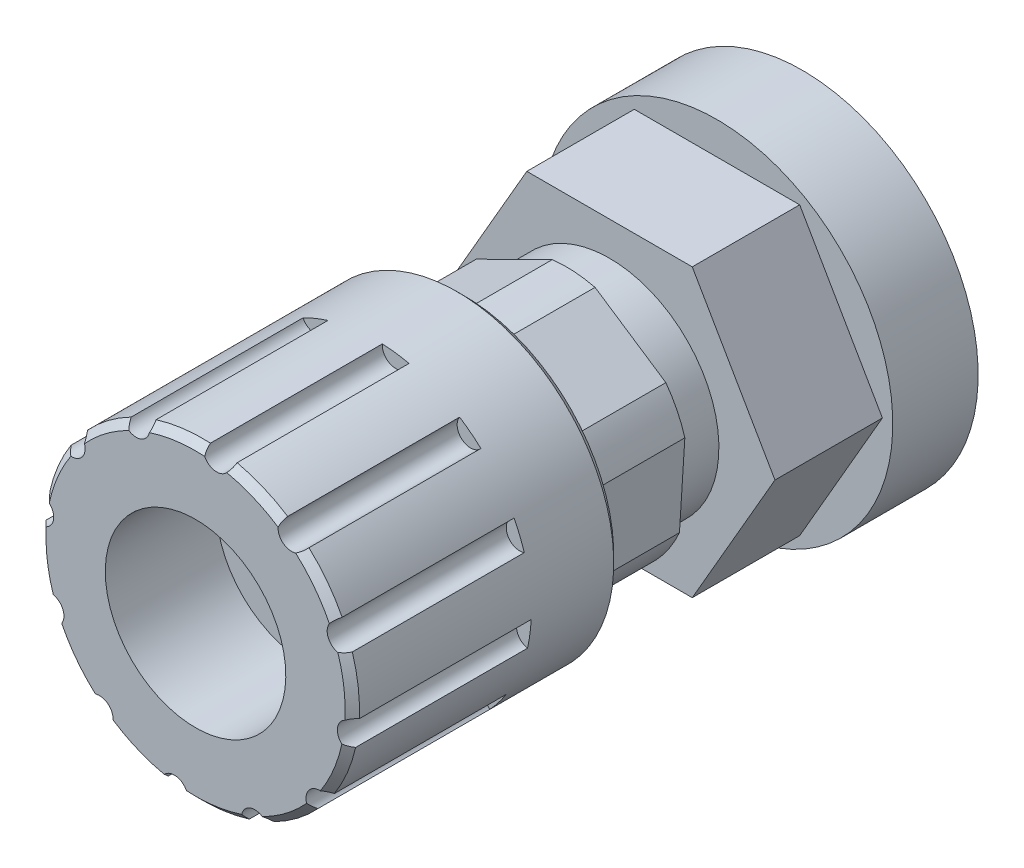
ISO-10303-21;
HEADER;
FILE_DESCRIPTION(('STEP AP214'),'2;1');
FILE_NAME('part.step','',(''),(''),'','','');
FILE_SCHEMA(('AUTOMOTIVE_DESIGN { 1 0 10303 214 1 1 1 1 }'));
ENDSEC;
DATA;
#1=APPLICATION_CONTEXT('core data for automotive mechanical design processes');
#2=APPLICATION_PROTOCOL_DEFINITION('international standard','automotive_design',2000,#1);
#3=PRODUCT_CONTEXT('',#1,'mechanical');
#4=PRODUCT('Part','Part','',(#3));
#5=PRODUCT_RELATED_PRODUCT_CATEGORY('part','',(#4));
#6=PRODUCT_DEFINITION_FORMATION('','',#4);
#7=PRODUCT_DEFINITION_CONTEXT('part definition',#1,'design');
#8=PRODUCT_DEFINITION('design','',#6,#7);
#9=PRODUCT_DEFINITION_SHAPE('','',#8);
#10=(LENGTH_UNIT() NAMED_UNIT(*) SI_UNIT(.MILLI.,.METRE.));
#11=(NAMED_UNIT(*) PLANE_ANGLE_UNIT() SI_UNIT($,.RADIAN.));
#12=(NAMED_UNIT(*) SI_UNIT($,.STERADIAN.) SOLID_ANGLE_UNIT());
#13=UNCERTAINTY_MEASURE_WITH_UNIT(LENGTH_MEASURE(1.E-05),#10,'distance_accuracy_value','');
#14=(GEOMETRIC_REPRESENTATION_CONTEXT(3) GLOBAL_UNCERTAINTY_ASSIGNED_CONTEXT((#13)) GLOBAL_UNIT_ASSIGNED_CONTEXT((#10,
#11,#12)) REPRESENTATION_CONTEXT('',''));
#15=CARTESIAN_POINT('',(0.,0.,0.));
#16=DIRECTION('',(0.,0.,1.));
#17=DIRECTION('',(1.,0.,0.));
#18=AXIS2_PLACEMENT_3D('',#15,#16,#17);
#19=CARTESIAN_POINT('',(-96.2151707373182,43.3915220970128,90.490509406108));
#20=DIRECTION('',(0.,0.,1.));
#21=DIRECTION('',(0.612367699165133,0.790573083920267,0.));
#22=AXIS2_PLACEMENT_3D('',#19,#20,#21);
#23=PLANE('',#22);
#24=CARTESIAN_POINT('',(-73.0475771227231,7.87186355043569,90.490509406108));
#25=DIRECTION('',(0.,0.,1.));
#26=DIRECTION('',(0.612367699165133,0.790573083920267,0.));
#27=AXIS2_PLACEMENT_3D('',#24,#25,#26);
#28=CIRCLE('',#27,2.3876);
#29=CARTESIAN_POINT('',(-71.7291920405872,9.86246510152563,90.490509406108));
#30=VERTEX_POINT('',#29);
#31=CARTESIAN_POINT('',(-75.3829581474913,8.3684813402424,90.490509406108));
#32=VERTEX_POINT('',#31);
#33=EDGE_CURVE('E198',#30,#32,#28,.T.);
#34=ORIENTED_EDGE('',*,*,#33,.F.);
#35=CARTESIAN_POINT('',(-83.5644202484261,33.5924141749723,90.490509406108));
#36=DIRECTION('',(0.,0.,1.));
#37=DIRECTION('',(0.612367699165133,0.790573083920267,0.));
#38=AXIS2_PLACEMENT_3D('',#35,#36,#37);
#39=CIRCLE('',#38,26.5176);
#40=CARTESIAN_POINT('',(-63.8670998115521,15.8385786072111,90.490509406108));
#41=VERTEX_POINT('',#40);
#42=EDGE_CURVE('E572',#30,#41,#39,.T.);
#43=ORIENTED_EDGE('',*,*,#42,.T.);
#44=CARTESIAN_POINT('',(-61.5962916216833,16.5761854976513,90.490509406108));
#45=DIRECTION('',(0.,0.,1.));
#46=DIRECTION('',(0.612367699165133,0.790573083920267,0.));
#47=AXIS2_PLACEMENT_3D('',#44,#45,#46);
#48=CIRCLE('',#47,2.3876);
#49=CARTESIAN_POINT('',(-61.4498374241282,18.9592895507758,90.490509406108));
#50=VERTEX_POINT('',#49);
#51=EDGE_CURVE('E457',#50,#41,#48,.T.);
#52=ORIENTED_EDGE('',*,*,#51,.F.);
#53=CARTESIAN_POINT('',(-57.6291225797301,28.0658017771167,90.490509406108));
#54=VERTEX_POINT('',#53);
#55=EDGE_CURVE('E592',#50,#54,#39,.T.);
#56=ORIENTED_EDGE('',*,*,#55,.T.);
#57=CARTESIAN_POINT('',(-56.0313484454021,29.8399921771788,90.490509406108));
#58=DIRECTION('',(0.,0.,1.));
#59=DIRECTION('',(0.612367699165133,0.790573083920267,0.));
#60=AXIS2_PLACEMENT_3D('',#57,#58,#59);
#61=CIRCLE('',#60,2.3876);
#62=CARTESIAN_POINT('',(-57.0960674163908,31.9770479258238,90.490509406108));
#63=VERTEX_POINT('',#62);
#64=EDGE_CURVE('E881',#63,#54,#61,.T.);
#65=ORIENTED_EDGE('',*,*,#64,.F.);
#66=CARTESIAN_POINT('',(-58.3404874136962,41.7738762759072,90.490509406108));
#67=VERTEX_POINT('',#66);
#68=EDGE_CURVE('E571',#63,#67,#39,.T.);
#69=ORIENTED_EDGE('',*,*,#68,.T.);
#70=CARTESIAN_POINT('',(-57.8438696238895,44.1092573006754,90.490509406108));
#71=DIRECTION('',(0.,0.,1.));
#72=DIRECTION('',(0.612367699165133,0.790573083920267,0.));
#73=AXIS2_PLACEMENT_3D('',#70,#71,#72);
#74=CIRCLE('',#73,2.3876);
#75=CARTESIAN_POINT('',(-59.8344711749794,45.4276423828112,90.490509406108));
#76=VERTEX_POINT('',#75);
#77=EDGE_CURVE('E1094',#76,#67,#74,.T.);
#78=ORIENTED_EDGE('',*,*,#77,.F.);
#79=CARTESIAN_POINT('',(-65.8105846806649,53.2897346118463,90.490509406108));
#80=VERTEX_POINT('',#79);
#81=EDGE_CURVE('E561',#76,#80,#39,.T.);
#82=ORIENTED_EDGE('',*,*,#81,.T.);
#83=CARTESIAN_POINT('',(-66.5481915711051,55.5605428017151,90.490509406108));
#84=DIRECTION('',(0.,0.,1.));
#85=DIRECTION('',(0.612367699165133,0.790573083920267,0.));
#86=AXIS2_PLACEMENT_3D('',#83,#84,#85);
#87=CIRCLE('',#86,2.3876);
#88=CARTESIAN_POINT('',(-68.9312956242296,55.7069969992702,90.490509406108));
#89=VERTEX_POINT('',#88);
#90=EDGE_CURVE('E548',#89,#80,#87,.T.);
#91=ORIENTED_EDGE('',*,*,#90,.F.);
#92=CARTESIAN_POINT('',(-78.0378078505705,59.5277118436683,90.490509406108));
#93=VERTEX_POINT('',#92);
#94=EDGE_CURVE('E558',#89,#93,#39,.T.);
#95=ORIENTED_EDGE('',*,*,#94,.T.);
#96=CARTESIAN_POINT('',(-79.8119982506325,61.1254859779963,90.490509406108));
#97=DIRECTION('',(0.,0.,1.));
#98=DIRECTION('',(0.612367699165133,0.790573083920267,0.));
#99=AXIS2_PLACEMENT_3D('',#96,#97,#98);
#100=CIRCLE('',#99,2.3876);
#101=CARTESIAN_POINT('',(-81.9490539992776,60.0607670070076,90.490509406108));
#102=VERTEX_POINT('',#101);
#103=EDGE_CURVE('E355',#102,#93,#100,.T.);
#104=ORIENTED_EDGE('',*,*,#103,.F.);
#105=CARTESIAN_POINT('',(-91.7458823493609,58.8163470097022,90.490509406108));
#106=VERTEX_POINT('',#105);
#107=EDGE_CURVE('E565',#102,#106,#39,.T.);
#108=ORIENTED_EDGE('',*,*,#107,.T.);
#109=CARTESIAN_POINT('',(-94.0812633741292,59.312964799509,90.490509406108));
#110=DIRECTION('',(0.,0.,1.));
#111=DIRECTION('',(0.612367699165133,0.790573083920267,0.));
#112=AXIS2_PLACEMENT_3D('',#109,#110,#111);
#113=CIRCLE('',#112,2.3876);
#114=CARTESIAN_POINT('',(-95.399648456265,57.322363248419,90.490509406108));
#115=VERTEX_POINT('',#114);
#116=EDGE_CURVE('E680',#115,#106,#113,.T.);
#117=ORIENTED_EDGE('',*,*,#116,.F.);
#118=CARTESIAN_POINT('',(-103.2617406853,51.3462497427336,90.490509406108));
#119=VERTEX_POINT('',#118);
#120=EDGE_CURVE('E574',#115,#119,#39,.T.);
#121=ORIENTED_EDGE('',*,*,#120,.T.);
#122=CARTESIAN_POINT('',(-105.532548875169,50.6086428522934,90.490509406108));
#123=DIRECTION('',(0.,0.,1.));
#124=DIRECTION('',(0.612367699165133,0.790573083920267,0.));
#125=AXIS2_PLACEMENT_3D('',#122,#123,#124);
#126=CIRCLE('',#125,2.3876);
#127=CARTESIAN_POINT('',(-105.679003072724,48.2255387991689,90.490509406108));
#128=VERTEX_POINT('',#127);
#129=EDGE_CURVE('E442',#128,#119,#126,.T.);
#130=ORIENTED_EDGE('',*,*,#129,.F.);
#131=CARTESIAN_POINT('',(-109.499717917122,39.1190265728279,90.490509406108));
#132=VERTEX_POINT('',#131);
#133=EDGE_CURVE('E576',#128,#132,#39,.T.);
#134=ORIENTED_EDGE('',*,*,#133,.T.);
#135=CARTESIAN_POINT('',(-111.09749205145,37.3448361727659,90.490509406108));
#136=DIRECTION('',(0.,0.,1.));
#137=DIRECTION('',(0.612367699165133,0.790573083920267,0.));
#138=AXIS2_PLACEMENT_3D('',#135,#136,#137);
#139=CIRCLE('',#138,2.3876);
#140=CARTESIAN_POINT('',(-110.032773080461,35.2077804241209,90.490509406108));
#141=VERTEX_POINT('',#140);
#142=EDGE_CURVE('E794',#141,#132,#139,.T.);
#143=ORIENTED_EDGE('',*,*,#142,.F.);
#144=CARTESIAN_POINT('',(-108.788353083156,25.4109520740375,90.490509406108));
#145=VERTEX_POINT('',#144);
#146=EDGE_CURVE('E567',#141,#145,#39,.T.);
#147=ORIENTED_EDGE('',*,*,#146,.T.);
#148=CARTESIAN_POINT('',(-109.284970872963,23.0755710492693,90.490509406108));
#149=DIRECTION('',(0.,0.,1.));
#150=DIRECTION('',(0.612367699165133,0.790573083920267,0.));
#151=AXIS2_PLACEMENT_3D('',#148,#149,#150);
#152=CIRCLE('',#151,2.38759999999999);
#153=CARTESIAN_POINT('',(-107.294369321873,21.7571859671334,90.490509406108));
#154=VERTEX_POINT('',#153);
#155=EDGE_CURVE('E734',#154,#145,#152,.T.);
#156=ORIENTED_EDGE('',*,*,#155,.F.);
#157=CARTESIAN_POINT('',(-101.318255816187,13.8950937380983,90.490509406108));
#158=VERTEX_POINT('',#157);
#159=EDGE_CURVE('E581',#154,#158,#39,.T.);
#160=ORIENTED_EDGE('',*,*,#159,.T.);
#161=CARTESIAN_POINT('',(-100.580648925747,11.6242855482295,90.490509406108));
#162=DIRECTION('',(0.,0.,1.));
#163=DIRECTION('',(0.612367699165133,0.790573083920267,0.));
#164=AXIS2_PLACEMENT_3D('',#161,#162,#163);
#165=CIRCLE('',#164,2.3876);
#166=CARTESIAN_POINT('',(-98.1975448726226,11.4778313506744,90.490509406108));
#167=VERTEX_POINT('',#166);
#168=EDGE_CURVE('E2786',#167,#158,#165,.T.);
#169=ORIENTED_EDGE('',*,*,#168,.F.);
#170=CARTESIAN_POINT('',(-89.0910326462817,7.65711650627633,90.490509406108));
#171=VERTEX_POINT('',#170);
#172=EDGE_CURVE('E582',#167,#171,#39,.T.);
#173=ORIENTED_EDGE('',*,*,#172,.T.);
#174=CARTESIAN_POINT('',(-87.3168422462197,6.05934237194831,90.490509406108));
#175=DIRECTION('',(0.,0.,1.));
#176=DIRECTION('',(0.612367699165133,0.790573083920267,0.));
#177=AXIS2_PLACEMENT_3D('',#174,#175,#176);
#178=CIRCLE('',#177,2.3876);
#179=CARTESIAN_POINT('',(-85.1797864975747,7.12406134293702,90.490509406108));
#180=VERTEX_POINT('',#179);
#181=EDGE_CURVE('E2886',#180,#171,#178,.T.);
#182=ORIENTED_EDGE('',*,*,#181,.F.);
#183=EDGE_CURVE('E575',#180,#32,#39,.T.);
#184=ORIENTED_EDGE('',*,*,#183,.T.);
#185=EDGE_LOOP('',(#34,#43,#52,#56,#65,#69,#78,#82,#91,#95,#104,#108,#117,#121,#130,#134,#143,
#147,#156,#160,#169,#173,#182,#184));
#186=FACE_BOUND('',#185,.T.);
#187=CARTESIAN_POINT('',(-83.5644202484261,33.5924141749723,90.490509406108));
#188=DIRECTION('',(0.,0.,1.));
#189=DIRECTION('',(0.612367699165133,0.790573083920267,0.));
#190=AXIS2_PLACEMENT_3D('',#187,#188,#189);
#191=CIRCLE('',#190,16.002);
#192=CARTESIAN_POINT('',(-73.7653123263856,46.2431646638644,90.490509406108));
#193=VERTEX_POINT('',#192);
#194=EDGE_CURVE('E2270',#193,#193,#191,.T.);
#195=ORIENTED_EDGE('',*,*,#194,.F.);
#196=EDGE_LOOP('',(#195));
#197=FACE_BOUND('',#196,.T.);
#198=ADVANCED_FACE('F16',(#186,#197),#23,.T.);
#199=CARTESIAN_POINT('',(-68.8997234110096,8.19241417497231,17.0942));
#200=DIRECTION('',(0.,0.,-1.));
#201=DIRECTION('',(-1.,0.,0.));
#202=AXIS2_PLACEMENT_3D('',#199,#200,#201);
#203=PLANE('',#202);
#204=DIRECTION('',(0.5,0.866025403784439,0.));
#205=VECTOR('',#204,1.);
#206=CARTESIAN_POINT('',(-68.8997234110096,8.19241417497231,17.0942));
#207=LINE('',#206,#205);
#208=CARTESIAN_POINT('',(-68.8997234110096,8.19241417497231,17.0942));
#209=VERTEX_POINT('',#208);
#210=CARTESIAN_POINT('',(-54.2350265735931,33.5924141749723,17.0942));
#211=VERTEX_POINT('',#210);
#212=EDGE_CURVE('E147',#209,#211,#207,.T.);
#213=ORIENTED_EDGE('',*,*,#212,.T.);
#214=DIRECTION('',(-0.5,0.866025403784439,0.));
#215=VECTOR('',#214,1.);
#216=CARTESIAN_POINT('',(-54.2350265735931,33.5924141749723,17.0942));
#217=LINE('',#216,#215);
#218=CARTESIAN_POINT('',(-68.8997234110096,58.9924141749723,17.0942));
#219=VERTEX_POINT('',#218);
#220=EDGE_CURVE('E84',#211,#219,#217,.T.);
#221=ORIENTED_EDGE('',*,*,#220,.T.);
#222=DIRECTION('',(-1.,0.,0.));
#223=VECTOR('',#222,1.);
#224=CARTESIAN_POINT('',(-68.8997234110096,58.9924141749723,17.0942));
#225=LINE('',#224,#223);
#226=CARTESIAN_POINT('',(-98.2291170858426,58.9924141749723,17.0942));
#227=VERTEX_POINT('',#226);
#228=EDGE_CURVE('E103',#219,#227,#225,.T.);
#229=ORIENTED_EDGE('',*,*,#228,.T.);
#230=DIRECTION('',(-0.5,-0.866025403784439,0.));
#231=VECTOR('',#230,1.);
#232=CARTESIAN_POINT('',(-98.2291170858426,58.9924141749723,17.0942));
#233=LINE('',#232,#231);
#234=CARTESIAN_POINT('',(-112.893813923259,33.5924141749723,17.0942));
#235=VERTEX_POINT('',#234);
#236=EDGE_CURVE('E96',#227,#235,#233,.T.);
#237=ORIENTED_EDGE('',*,*,#236,.T.);
#238=DIRECTION('',(0.5,-0.866025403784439,0.));
#239=VECTOR('',#238,1.);
#240=CARTESIAN_POINT('',(-112.893813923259,33.5924141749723,17.0942));
#241=LINE('',#240,#239);
#242=CARTESIAN_POINT('',(-98.2291170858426,8.19241417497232,17.0942));
#243=VERTEX_POINT('',#242);
#244=EDGE_CURVE('E101',#235,#243,#241,.T.);
#245=ORIENTED_EDGE('',*,*,#244,.T.);
#246=DIRECTION('',(1.,0.,0.));
#247=VECTOR('',#246,1.);
#248=CARTESIAN_POINT('',(-98.2291170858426,8.19241417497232,17.0942));
#249=LINE('',#248,#247);
#250=EDGE_CURVE('E46',#243,#209,#249,.T.);
#251=ORIENTED_EDGE('',*,*,#250,.T.);
#252=EDGE_LOOP('',(#213,#221,#229,#237,#245,#251));
#253=FACE_BOUND('',#252,.T.);
#254=CARTESIAN_POINT('',(-83.5644202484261,33.5924141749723,17.0942));
#255=DIRECTION('',(0.,0.,-1.));
#256=DIRECTION('',(-1.,0.,0.));
#257=AXIS2_PLACEMENT_3D('',#254,#255,#256);
#258=CIRCLE('',#257,19.3929);
#259=CARTESIAN_POINT('',(-102.957320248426,33.5924141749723,17.0942));
#260=VERTEX_POINT('',#259);
#261=EDGE_CURVE('E10',#260,#260,#258,.F.);
#262=ORIENTED_EDGE('',*,*,#261,.F.);
#263=EDGE_LOOP('',(#262));
#264=FACE_BOUND('',#263,.T.);
#265=ADVANCED_FACE('F98',(#253,#264),#203,.F.);
#266=CARTESIAN_POINT('',(-83.5644202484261,33.5924141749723,-1.9558));
#267=DIRECTION('',(0.,0.,1.));
#268=DIRECTION('',(1.,0.,0.));
#269=AXIS2_PLACEMENT_3D('',#266,#267,#268);
#270=PLANE('',#269);
#271=CARTESIAN_POINT('',(-83.5644202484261,33.5924141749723,-1.9558));
#272=DIRECTION('',(0.,0.,-1.));
#273=DIRECTION('',(-1.,0.,0.));
#274=AXIS2_PLACEMENT_3D('',#271,#272,#273);
#275=CIRCLE('',#274,31.1658);
#276=CARTESIAN_POINT('',(-114.730220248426,33.5924141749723,-1.9558));
#277=VERTEX_POINT('',#276);
#278=EDGE_CURVE('E161',#277,#277,#275,.T.);
#279=ORIENTED_EDGE('',*,*,#278,.F.);
#280=EDGE_LOOP('',(#279));
#281=FACE_BOUND('',#280,.T.);
#282=DIRECTION('',(-0.5,0.866025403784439,0.));
#283=VECTOR('',#282,1.);
#284=CARTESIAN_POINT('',(-54.2350265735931,33.5924141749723,-1.9558));
#285=LINE('',#284,#283);
#286=CARTESIAN_POINT('',(-54.2350265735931,33.5924141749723,-1.9558));
#287=VERTEX_POINT('',#286);
#288=CARTESIAN_POINT('',(-68.8997234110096,58.9924141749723,-1.9558));
#289=VERTEX_POINT('',#288);
#290=EDGE_CURVE('E133',#287,#289,#285,.T.);
#291=ORIENTED_EDGE('',*,*,#290,.F.);
#292=DIRECTION('',(0.5,0.866025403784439,0.));
#293=VECTOR('',#292,1.);
#294=CARTESIAN_POINT('',(-68.8997234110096,8.19241417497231,-1.9558));
#295=LINE('',#294,#293);
#296=CARTESIAN_POINT('',(-68.8997234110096,8.19241417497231,-1.9558));
#297=VERTEX_POINT('',#296);
#298=EDGE_CURVE('E129',#297,#287,#295,.T.);
#299=ORIENTED_EDGE('',*,*,#298,.F.);
#300=DIRECTION('',(1.,0.,0.));
#301=VECTOR('',#300,1.);
#302=CARTESIAN_POINT('',(-98.2291170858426,8.19241417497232,-1.9558));
#303=LINE('',#302,#301);
#304=CARTESIAN_POINT('',(-98.2291170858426,8.19241417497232,-1.9558));
#305=VERTEX_POINT('',#304);
#306=EDGE_CURVE('E74',#305,#297,#303,.T.);
#307=ORIENTED_EDGE('',*,*,#306,.F.);
#308=DIRECTION('',(0.5,-0.866025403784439,0.));
#309=VECTOR('',#308,1.);
#310=CARTESIAN_POINT('',(-112.893813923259,33.5924141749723,-1.9558));
#311=LINE('',#310,#309);
#312=CARTESIAN_POINT('',(-112.893813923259,33.5924141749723,-1.9558));
#313=VERTEX_POINT('',#312);
#314=EDGE_CURVE('E142',#313,#305,#311,.T.);
#315=ORIENTED_EDGE('',*,*,#314,.F.);
#316=DIRECTION('',(-0.5,-0.866025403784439,0.));
#317=VECTOR('',#316,1.);
#318=CARTESIAN_POINT('',(-98.2291170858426,58.9924141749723,-1.9558));
#319=LINE('',#318,#317);
#320=CARTESIAN_POINT('',(-98.2291170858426,58.9924141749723,-1.9558));
#321=VERTEX_POINT('',#320);
#322=EDGE_CURVE('E113',#321,#313,#319,.T.);
#323=ORIENTED_EDGE('',*,*,#322,.F.);
#324=DIRECTION('',(-1.,0.,0.));
#325=VECTOR('',#324,1.);
#326=CARTESIAN_POINT('',(-68.8997234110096,58.9924141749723,-1.9558));
#327=LINE('',#326,#325);
#328=EDGE_CURVE('E137',#289,#321,#327,.T.);
#329=ORIENTED_EDGE('',*,*,#328,.F.);
#330=EDGE_LOOP('',(#291,#299,#307,#315,#323,#329));
#331=FACE_BOUND('',#330,.T.);
#332=ADVANCED_FACE('F18',(#281,#331),#270,.T.);
#333=CARTESIAN_POINT('',(-83.5644202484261,61.6467141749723,-17.0942));
#334=DIRECTION('',(0.,0.,-1.));
#335=DIRECTION('',(-1.,0.,0.));
#336=AXIS2_PLACEMENT_3D('',#333,#334,#335);
#337=PLANE('',#336);
#338=CARTESIAN_POINT('',(-83.5644202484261,33.5924141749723,-17.0942));
#339=DIRECTION('',(0.,0.,-1.));
#340=DIRECTION('',(-1.,0.,0.));
#341=AXIS2_PLACEMENT_3D('',#338,#339,#340);
#342=CIRCLE('',#341,31.1658);
#343=CARTESIAN_POINT('',(-114.730220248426,33.5924141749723,-17.0942));
#344=VERTEX_POINT('',#343);
#345=EDGE_CURVE('E24',#344,#344,#342,.T.);
#346=ORIENTED_EDGE('',*,*,#345,.T.);
#347=EDGE_LOOP('',(#346));
#348=FACE_BOUND('',#347,.T.);
#349=ADVANCED_FACE('F169',(#348),#337,.T.);
#350=CARTESIAN_POINT('',(-83.5644202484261,33.5924141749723,-43.5864));
#351=DIRECTION('',(0.,0.,-1.));
#352=DIRECTION('',(-1.,0.,0.));
#353=AXIS2_PLACEMENT_3D('',#350,#351,#352);
#354=CYLINDRICAL_SURFACE('',#353,31.1658);
#355=ORIENTED_EDGE('',*,*,#345,.F.);
#356=EDGE_LOOP('',(#355));
#357=FACE_BOUND('',#356,.T.);
#358=ORIENTED_EDGE('',*,*,#278,.T.);
#359=EDGE_LOOP('',(#358));
#360=FACE_BOUND('',#359,.T.);
#361=ADVANCED_FACE('F171',(#357,#360),#354,.T.);
#362=CARTESIAN_POINT('',(-68.8997234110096,8.19241417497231,17.0942));
#363=DIRECTION('',(-0.866025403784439,0.5,0.));
#364=DIRECTION('',(-0.5,-0.866025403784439,0.));
#365=AXIS2_PLACEMENT_3D('',#362,#363,#364);
#366=PLANE('',#365);
#367=ORIENTED_EDGE('',*,*,#298,.T.);
#368=DIRECTION('',(0.,0.,-1.));
#369=VECTOR('',#368,1.);
#370=CARTESIAN_POINT('',(-54.2350265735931,33.5924141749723,17.0942));
#371=LINE('',#370,#369);
#372=EDGE_CURVE('E158',#211,#287,#371,.T.);
#373=ORIENTED_EDGE('',*,*,#372,.F.);
#374=ORIENTED_EDGE('',*,*,#212,.F.);
#375=DIRECTION('',(0.,0.,-1.));
#376=VECTOR('',#375,1.);
#377=CARTESIAN_POINT('',(-68.8997234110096,8.19241417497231,17.0942));
#378=LINE('',#377,#376);
#379=EDGE_CURVE('E125',#209,#297,#378,.T.);
#380=ORIENTED_EDGE('',*,*,#379,.T.);
#381=EDGE_LOOP('',(#367,#373,#374,#380));
#382=FACE_BOUND('',#381,.T.);
#383=ADVANCED_FACE('F174',(#382),#366,.F.);
#384=CARTESIAN_POINT('',(-54.2350265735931,33.5924141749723,17.0942));
#385=DIRECTION('',(-0.866025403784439,-0.5,0.));
#386=DIRECTION('',(0.5,-0.866025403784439,0.));
#387=AXIS2_PLACEMENT_3D('',#384,#385,#386);
#388=PLANE('',#387);
#389=ORIENTED_EDGE('',*,*,#290,.T.);
#390=DIRECTION('',(0.,0.,-1.));
#391=VECTOR('',#390,1.);
#392=CARTESIAN_POINT('',(-68.8997234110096,58.9924141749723,17.0942));
#393=LINE('',#392,#391);
#394=EDGE_CURVE('E154',#219,#289,#393,.T.);
#395=ORIENTED_EDGE('',*,*,#394,.F.);
#396=ORIENTED_EDGE('',*,*,#220,.F.);
#397=ORIENTED_EDGE('',*,*,#372,.T.);
#398=EDGE_LOOP('',(#389,#395,#396,#397));
#399=FACE_BOUND('',#398,.T.);
#400=ADVANCED_FACE('F183',(#399),#388,.F.);
#401=CARTESIAN_POINT('',(-68.8997234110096,58.9924141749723,17.0942));
#402=DIRECTION('',(0.,-1.,0.));
#403=DIRECTION('',(1.,0.,0.));
#404=AXIS2_PLACEMENT_3D('',#401,#402,#403);
#405=PLANE('',#404);
#406=ORIENTED_EDGE('',*,*,#328,.T.);
#407=DIRECTION('',(0.,0.,-1.));
#408=VECTOR('',#407,1.);
#409=CARTESIAN_POINT('',(-98.2291170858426,58.9924141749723,17.0942));
#410=LINE('',#409,#408);
#411=EDGE_CURVE('E117',#227,#321,#410,.T.);
#412=ORIENTED_EDGE('',*,*,#411,.F.);
#413=ORIENTED_EDGE('',*,*,#228,.F.);
#414=ORIENTED_EDGE('',*,*,#394,.T.);
#415=EDGE_LOOP('',(#406,#412,#413,#414));
#416=FACE_BOUND('',#415,.T.);
#417=ADVANCED_FACE('F186',(#416),#405,.F.);
#418=CARTESIAN_POINT('',(-98.2291170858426,58.9924141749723,17.0942));
#419=DIRECTION('',(0.866025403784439,-0.5,0.));
#420=DIRECTION('',(0.5,0.866025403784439,0.));
#421=AXIS2_PLACEMENT_3D('',#418,#419,#420);
#422=PLANE('',#421);
#423=ORIENTED_EDGE('',*,*,#322,.T.);
#424=DIRECTION('',(0.,0.,-1.));
#425=VECTOR('',#424,1.);
#426=CARTESIAN_POINT('',(-112.893813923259,33.5924141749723,17.0942));
#427=LINE('',#426,#425);
#428=EDGE_CURVE('E110',#235,#313,#427,.T.);
#429=ORIENTED_EDGE('',*,*,#428,.F.);
#430=ORIENTED_EDGE('',*,*,#236,.F.);
#431=ORIENTED_EDGE('',*,*,#411,.T.);
#432=EDGE_LOOP('',(#423,#429,#430,#431));
#433=FACE_BOUND('',#432,.T.);
#434=ADVANCED_FACE('F111',(#433),#422,.F.);
#435=CARTESIAN_POINT('',(-112.893813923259,33.5924141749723,17.0942));
#436=DIRECTION('',(0.866025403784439,0.5,0.));
#437=DIRECTION('',(-0.5,0.866025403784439,0.));
#438=AXIS2_PLACEMENT_3D('',#435,#436,#437);
#439=PLANE('',#438);
#440=ORIENTED_EDGE('',*,*,#314,.T.);
#441=DIRECTION('',(0.,0.,-1.));
#442=VECTOR('',#441,1.);
#443=CARTESIAN_POINT('',(-98.2291170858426,8.19241417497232,17.0942));
#444=LINE('',#443,#442);
#445=EDGE_CURVE('E36',#243,#305,#444,.T.);
#446=ORIENTED_EDGE('',*,*,#445,.F.);
#447=ORIENTED_EDGE('',*,*,#244,.F.);
#448=ORIENTED_EDGE('',*,*,#428,.T.);
#449=EDGE_LOOP('',(#440,#446,#447,#448));
#450=FACE_BOUND('',#449,.T.);
#451=ADVANCED_FACE('F119',(#450),#439,.F.);
#452=CARTESIAN_POINT('',(-98.2291170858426,8.19241417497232,17.0942));
#453=DIRECTION('',(0.,1.,0.));
#454=DIRECTION('',(-1.,0.,0.));
#455=AXIS2_PLACEMENT_3D('',#452,#453,#454);
#456=PLANE('',#455);
#457=ORIENTED_EDGE('',*,*,#306,.T.);
#458=ORIENTED_EDGE('',*,*,#379,.F.);
#459=ORIENTED_EDGE('',*,*,#250,.F.);
#460=ORIENTED_EDGE('',*,*,#445,.T.);
#461=EDGE_LOOP('',(#457,#458,#459,#460));
#462=FACE_BOUND('',#461,.T.);
#463=ADVANCED_FACE('F1895',(#462),#456,.F.);
#464=CARTESIAN_POINT('',(-83.5644202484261,33.5924141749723,73.0758));
#465=DIRECTION('',(0.,0.,1.));
#466=DIRECTION('',(0.553878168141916,0.832597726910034,0.));
#467=AXIS2_PLACEMENT_3D('',#464,#465,#466);
#468=CYLINDRICAL_SURFACE('',#467,19.3929);
#469=CARTESIAN_POINT('',(-83.5644202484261,33.5924141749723,24.8158));
#470=DIRECTION('',(0.,0.,1.));
#471=DIRECTION('',(0.553878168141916,0.832597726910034,0.));
#472=AXIS2_PLACEMENT_3D('',#469,#470,#471);
#473=CIRCLE('',#472,19.3929);
#474=CARTESIAN_POINT('',(-72.8231163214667,49.7388986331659,24.8158));
#475=VERTEX_POINT('',#474);
#476=EDGE_CURVE('E1207',#475,#475,#473,.T.);
#477=ORIENTED_EDGE('',*,*,#476,.F.);
#478=EDGE_LOOP('',(#477));
#479=FACE_BOUND('',#478,.T.);
#480=ORIENTED_EDGE('',*,*,#261,.T.);
#481=EDGE_LOOP('',(#480));
#482=FACE_BOUND('',#481,.T.);
#483=ADVANCED_FACE('F1890',(#479,#482),#468,.T.);
#484=CARTESIAN_POINT('',(-105.532548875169,50.6086428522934,42.865509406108));
#485=DIRECTION('',(0.,0.,-1.));
#486=DIRECTION('',(-0.612367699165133,-0.790573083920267,0.));
#487=AXIS2_PLACEMENT_3D('',#484,#485,#486);
#488=PLANE('',#487);
#489=CARTESIAN_POINT('',(-83.5644202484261,33.5924141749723,42.865509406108));
#490=DIRECTION('',(0.,0.,-1.));
#491=DIRECTION('',(-0.612367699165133,-0.790573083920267,0.));
#492=AXIS2_PLACEMENT_3D('',#489,#490,#491);
#493=CIRCLE('',#492,26.5176);
#494=CARTESIAN_POINT('',(-99.8029419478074,12.6283133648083,42.865509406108));
#495=VERTEX_POINT('',#494);
#496=EDGE_CURVE('E619',#495,#495,#493,.T.);
#497=ORIENTED_EDGE('',*,*,#496,.T.);
#498=EDGE_LOOP('',(#497));
#499=FACE_BOUND('',#498,.T.);
#500=CARTESIAN_POINT('',(-83.5644202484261,33.5924141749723,42.865509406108));
#501=DIRECTION('',(0.,0.,-1.));
#502=DIRECTION('',(-0.553878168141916,-0.832597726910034,0.));
#503=AXIS2_PLACEMENT_3D('',#500,#501,#502);
#504=CIRCLE('',#503,19.431);
#505=CARTESIAN_POINT('',(-94.3268269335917,17.4142077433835,42.865509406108));
#506=VERTEX_POINT('',#505);
#507=EDGE_CURVE('E194',#506,#506,#504,.F.);
#508=ORIENTED_EDGE('',*,*,#507,.T.);
#509=EDGE_LOOP('',(#508));
#510=FACE_BOUND('',#509,.T.);
#511=ADVANCED_FACE('F830',(#499,#510),#488,.T.);
#512=CARTESIAN_POINT('',(-83.5644202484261,33.5924141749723,90.490509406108));
#513=DIRECTION('',(0.,0.,-1.));
#514=DIRECTION('',(-0.612367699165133,-0.790573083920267,0.));
#515=AXIS2_PLACEMENT_3D('',#512,#513,#514);
#516=CONICAL_SURFACE('',#515,26.5176,0.785398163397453);
#517=CARTESIAN_POINT('',(-75.3829101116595,8.36870717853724,90.4907094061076));
#518=CARTESIAN_POINT('',(-75.3988641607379,8.29363381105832,90.4242169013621));
#519=CARTESIAN_POINT('',(-75.4110310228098,8.21874769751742,90.3566589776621));
#520=CARTESIAN_POINT('',(-75.4281545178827,8.06968308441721,90.2199102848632));
#521=CARTESIAN_POINT('',(-75.4331135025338,7.99550436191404,90.1507200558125));
#522=CARTESIAN_POINT('',(-75.4361752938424,7.84909588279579,90.0120676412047));
#523=CARTESIAN_POINT('',(-75.4343663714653,7.77685332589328,89.9426206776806));
#524=CARTESIAN_POINT('',(-75.4243432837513,7.63359476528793,89.8029466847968));
#525=CARTESIAN_POINT('',(-75.4161297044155,7.56257864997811,89.7327197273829));
#526=CARTESIAN_POINT('',(-75.3930681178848,7.41935077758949,89.5891356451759));
#527=CARTESIAN_POINT('',(-75.3779807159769,7.34719553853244,89.5157606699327));
#528=CARTESIAN_POINT('',(-75.3411352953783,7.20425949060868,89.3683346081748));
#529=CARTESIAN_POINT('',(-75.3193322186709,7.13349150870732,89.2942823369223));
#530=CARTESIAN_POINT('',(-75.2942832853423,7.06381331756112,89.220309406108));
#531=B_SPLINE_CURVE_WITH_KNOTS('',3,(#517,#518,#519,#520,#521,#522,#523,#524,#525,#526,#527,
#528,#529,#530),.UNSPECIFIED.,.F.,.F.,(4,2,2,2,2,2,4),(0.,0.304512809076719,0.608926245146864,
0.909383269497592,1.2098128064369,1.52161602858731,1.83555858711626),.UNSPECIFIED.);
#532=CARTESIAN_POINT('',(-75.2943510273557,7.06400169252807,89.220509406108));
#533=VERTEX_POINT('',#532);
#534=EDGE_CURVE('E1074',#32,#533,#531,.T.);
#535=ORIENTED_EDGE('',*,*,#534,.F.);
#536=ORIENTED_EDGE('',*,*,#183,.F.);
#537=CARTESIAN_POINT('',(-84.9394631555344,5.83865612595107,89.220309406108));
#538=CARTESIAN_POINT('',(-84.9308382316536,5.93187014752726,89.3138285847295));
#539=CARTESIAN_POINT('',(-84.9276516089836,6.02547830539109,89.4074859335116));
#540=CARTESIAN_POINT('',(-84.9323356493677,6.21299757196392,89.5945455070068));
#541=CARTESIAN_POINT('',(-84.9402257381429,6.3069089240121,89.687946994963));
#542=CARTESIAN_POINT('',(-84.9670253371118,6.49248539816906,89.8719131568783));
#543=CARTESIAN_POINT('',(-84.9857283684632,6.58415994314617,89.9624983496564));
#544=CARTESIAN_POINT('',(-85.0343526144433,6.76627059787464,90.141739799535));
#545=CARTESIAN_POINT('',(-85.0642608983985,6.85670801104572,90.230398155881));
#546=CARTESIAN_POINT('',(-85.1119922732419,6.97602408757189,90.3467699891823));
#547=CARTESIAN_POINT('',(-85.1246035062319,7.00579828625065,90.3757589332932));
#548=CARTESIAN_POINT('',(-85.15120718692,7.06518536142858,90.4334686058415));
#549=CARTESIAN_POINT('',(-85.1652037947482,7.09479745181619,90.4621882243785));
#550=CARTESIAN_POINT('',(-85.1798894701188,7.1242679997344,90.4907094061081));
#551=B_SPLINE_CURVE_WITH_KNOTS('',3,(#537,#538,#539,#540,#541,#542,#543,#544,#545,#546,#547,
#548,#549,#550),.UNSPECIFIED.,.F.,.F.,(4,2,2,2,2,2,4),(0.,0.396887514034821,0.794471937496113,
1.18470389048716,1.5744869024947,1.70475031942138,1.8354175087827),.UNSPECIFIED.);
#552=CARTESIAN_POINT('',(-84.9394446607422,5.83885545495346,89.220509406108));
#553=VERTEX_POINT('',#552);
#554=EDGE_CURVE('E775',#553,#180,#551,.T.);
#555=ORIENTED_EDGE('',*,*,#554,.F.);
#556=CARTESIAN_POINT('',(-83.5644202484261,33.5924141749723,89.220509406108));
#557=DIRECTION('',(0.,0.,1.));
#558=DIRECTION('',(0.612367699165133,0.790573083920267,0.));
#559=AXIS2_PLACEMENT_3D('',#556,#557,#558);
#560=CIRCLE('',#559,27.7876);
#561=EDGE_CURVE('E394',#533,#553,#560,.F.);
#562=ORIENTED_EDGE('',*,*,#561,.F.);
#563=EDGE_LOOP('',(#535,#536,#555,#562));
#564=FACE_BOUND('',#563,.T.);
#565=ADVANCED_FACE('F840',(#564),#516,.T.);
#566=CARTESIAN_POINT('',(-58.3407132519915,41.773924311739,90.490709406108));
#567=CARTESIAN_POINT('',(-58.2656398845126,41.7579702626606,90.4242169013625));
#568=CARTESIAN_POINT('',(-58.1907537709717,41.7458034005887,90.3566589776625));
#569=CARTESIAN_POINT('',(-58.0416891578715,41.7286799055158,90.2199102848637));
#570=CARTESIAN_POINT('',(-57.9675104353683,41.7237209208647,90.150720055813));
#571=CARTESIAN_POINT('',(-57.8211019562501,41.720659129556,90.0120676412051));
#572=CARTESIAN_POINT('',(-57.7488593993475,41.7224680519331,89.942620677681));
#573=CARTESIAN_POINT('',(-57.6056008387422,41.7324911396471,89.8029466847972));
#574=CARTESIAN_POINT('',(-57.5345847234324,41.7407047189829,89.7327197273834));
#575=CARTESIAN_POINT('',(-57.3913568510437,41.7637663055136,89.5891356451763));
#576=CARTESIAN_POINT('',(-57.3192016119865,41.7788537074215,89.515760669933));
#577=CARTESIAN_POINT('',(-57.1762655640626,41.8156991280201,89.3683346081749));
#578=CARTESIAN_POINT('',(-57.1054975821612,41.8375022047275,89.2942823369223));
#579=CARTESIAN_POINT('',(-57.0358193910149,41.8625511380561,89.220309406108));
#580=B_SPLINE_CURVE_WITH_KNOTS('',3,(#566,#567,#568,#569,#570,#571,#572,#573,#574,#575,#576,
#577,#578,#579),.UNSPECIFIED.,.F.,.F.,(4,2,2,2,2,2,4),(0.,0.304512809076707,0.608926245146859,
0.909383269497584,1.2098128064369,1.52161602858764,1.83555858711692),.UNSPECIFIED.);
#581=CARTESIAN_POINT('',(-57.0360077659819,41.8624833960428,89.220509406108));
#582=VERTEX_POINT('',#581);
#583=EDGE_CURVE('E1127',#67,#582,#580,.T.);
#584=ORIENTED_EDGE('',*,*,#583,.F.);
#585=ORIENTED_EDGE('',*,*,#68,.F.);
#586=CARTESIAN_POINT('',(-55.8106621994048,32.217371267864,89.220309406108));
#587=CARTESIAN_POINT('',(-55.903876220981,32.2259961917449,89.3138285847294));
#588=CARTESIAN_POINT('',(-55.9974843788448,32.2291828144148,89.4074859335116));
#589=CARTESIAN_POINT('',(-56.1850036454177,32.2244987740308,89.5945455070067));
#590=CARTESIAN_POINT('',(-56.2789149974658,32.2166086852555,89.6879469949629));
#591=CARTESIAN_POINT('',(-56.4644914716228,32.1898090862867,89.8719131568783));
#592=CARTESIAN_POINT('',(-56.5561660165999,32.1711060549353,89.9624983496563));
#593=CARTESIAN_POINT('',(-56.7382766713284,32.1224818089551,90.141739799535));
#594=CARTESIAN_POINT('',(-56.8287140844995,32.092573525,90.2303981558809));
#595=CARTESIAN_POINT('',(-56.9480301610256,32.0448421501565,90.3467699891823));
#596=CARTESIAN_POINT('',(-56.9778043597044,32.0322309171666,90.3757589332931));
#597=CARTESIAN_POINT('',(-57.0371914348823,32.0056272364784,90.4334686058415));
#598=CARTESIAN_POINT('',(-57.06680352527,31.9916306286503,90.4621882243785));
#599=CARTESIAN_POINT('',(-57.0962740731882,31.9769449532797,90.4907094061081));
#600=B_SPLINE_CURVE_WITH_KNOTS('',3,(#586,#587,#588,#589,#590,#591,#592,#593,#594,#595,#596,
#597,#598,#599),.UNSPECIFIED.,.F.,.F.,(4,2,2,2,2,2,4),(0.,0.396887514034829,0.794471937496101,
1.18470389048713,1.5744869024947,1.70475031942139,1.83541750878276),.UNSPECIFIED.);
#601=CARTESIAN_POINT('',(-55.8108615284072,32.2173897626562,89.220509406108));
#602=VERTEX_POINT('',#601);
#603=EDGE_CURVE('E675',#602,#63,#600,.T.);
#604=ORIENTED_EDGE('',*,*,#603,.F.);
#605=EDGE_CURVE('E388',#582,#602,#560,.F.);
#606=ORIENTED_EDGE('',*,*,#605,.F.);
#607=EDGE_LOOP('',(#584,#585,#604,#606));
#608=FACE_BOUND('',#607,.T.);
#609=ADVANCED_FACE('F678',(#608),#516,.T.);
#610=CARTESIAN_POINT('',(-58.8414392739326,46.2784711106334,89.220309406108));
#611=CARTESIAN_POINT('',(-58.9264774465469,46.2393335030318,89.3138285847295));
#612=CARTESIAN_POINT('',(-59.0091378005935,46.1952891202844,89.4074859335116));
#613=CARTESIAN_POINT('',(-59.1691922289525,46.097472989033,89.5945455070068));
#614=CARTESIAN_POINT('',(-59.2465768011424,46.0436842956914,89.687946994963));
#615=CARTESIAN_POINT('',(-59.3938909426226,45.9276869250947,89.8719131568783));
#616=CARTESIAN_POINT('',(-59.4639319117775,45.8656523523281,89.9624983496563));
#617=CARTESIAN_POINT('',(-59.5973322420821,45.7324871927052,90.141739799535));
#618=CARTESIAN_POINT('',(-59.6606991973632,45.6613671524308,90.2303981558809));
#619=CARTESIAN_POINT('',(-59.740164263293,45.5603725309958,90.3467699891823));
#620=CARTESIAN_POINT('',(-59.7596438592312,45.534563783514,90.3757589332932));
#621=CARTESIAN_POINT('',(-59.7977727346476,45.481830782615,90.4334686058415));
#622=CARTESIAN_POINT('',(-59.8164192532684,45.4549033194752,90.4621882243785));
#623=CARTESIAN_POINT('',(-59.8345986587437,45.4274498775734,90.4907094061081));
#624=B_SPLINE_CURVE_WITH_KNOTS('',3,(#610,#611,#612,#613,#614,#615,#616,#617,#618,#619,#620,
#621,#622,#623),.UNSPECIFIED.,.F.,.F.,(4,2,2,2,2,2,4),(0.,0.39688751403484,0.79447193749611,
1.18470389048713,1.5744869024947,1.7047503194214,1.83541750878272),.UNSPECIFIED.);
#625=CARTESIAN_POINT('',(-58.8416211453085,46.2783874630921,89.220509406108));
#626=VERTEX_POINT('',#625);
#627=EDGE_CURVE('E1132',#626,#76,#624,.T.);
#628=ORIENTED_EDGE('',*,*,#627,.F.);
#629=CARTESIAN_POINT('',(-64.7251757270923,54.0187104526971,89.220509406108));
#630=VERTEX_POINT('',#629);
#631=EDGE_CURVE('E378',#630,#626,#560,.F.);
#632=ORIENTED_EDGE('',*,*,#631,.F.);
#633=CARTESIAN_POINT('',(-65.8108042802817,53.2896632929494,90.490709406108));
#634=CARTESIAN_POINT('',(-65.7378118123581,53.3133833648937,90.4242169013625));
#635=CARTESIAN_POINT('',(-65.666875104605,53.3402896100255,90.3566589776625));
#636=CARTESIAN_POINT('',(-65.5292196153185,53.3999925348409,90.2199102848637));
#637=CARTESIAN_POINT('',(-65.4624994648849,53.4327872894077,90.150720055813));
#638=CARTESIAN_POINT('',(-65.3341751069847,53.5033399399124,90.0120676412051));
#639=CARTESIAN_POINT('',(-65.2725156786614,53.5410277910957,89.942620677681));
#640=CARTESIAN_POINT('',(-65.1534616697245,53.621337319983,89.8029466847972));
#641=CARTESIAN_POINT('',(-65.096066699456,53.6639585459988,89.7327197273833));
#642=CARTESIAN_POINT('',(-64.9835585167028,53.7555444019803,89.5891356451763));
#643=CARTESIAN_POINT('',(-64.9286139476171,53.8046880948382,89.515760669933));
#644=CARTESIAN_POINT('',(-64.8232504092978,53.9080651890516,89.368334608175));
#645=CARTESIAN_POINT('',(-64.7728650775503,53.9623311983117,89.2942823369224));
#646=CARTESIAN_POINT('',(-64.7250464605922,54.018863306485,89.220309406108));
#647=B_SPLINE_CURVE_WITH_KNOTS('',3,(#633,#634,#635,#636,#637,#638,#639,#640,#641,#642,#643,
#644,#645,#646),.UNSPECIFIED.,.F.,.F.,(4,2,2,2,2,2,4),(0.,0.304512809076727,0.608926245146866,
0.909383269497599,1.20981280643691,1.52161602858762,1.83555858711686),.UNSPECIFIED.);
#648=EDGE_CURVE('E321',#80,#630,#647,.T.);
#649=ORIENTED_EDGE('',*,*,#648,.F.);
#650=ORIENTED_EDGE('',*,*,#81,.F.);
#651=EDGE_LOOP('',(#628,#632,#649,#650));
#652=FACE_BOUND('',#651,.T.);
#653=ADVANCED_FACE('F1922',(#652),#516,.T.);
#654=CARTESIAN_POINT('',(-91.7459303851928,58.8161211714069,90.490709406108));
#655=CARTESIAN_POINT('',(-91.7299763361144,58.8911945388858,90.4242169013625));
#656=CARTESIAN_POINT('',(-91.7178094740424,58.9660806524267,90.3566589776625));
#657=CARTESIAN_POINT('',(-91.7006859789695,59.1151452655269,90.2199102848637));
#658=CARTESIAN_POINT('',(-91.6957269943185,59.1893239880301,90.150720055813));
#659=CARTESIAN_POINT('',(-91.6926652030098,59.3357324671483,90.0120676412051));
#660=CARTESIAN_POINT('',(-91.6944741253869,59.4079750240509,89.942620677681));
#661=CARTESIAN_POINT('',(-91.7044972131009,59.5512335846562,89.8029466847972));
#662=CARTESIAN_POINT('',(-91.7127107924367,59.622249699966,89.7327197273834));
#663=CARTESIAN_POINT('',(-91.7357723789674,59.7654775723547,89.5891356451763));
#664=CARTESIAN_POINT('',(-91.7508597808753,59.8376328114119,89.515760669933));
#665=CARTESIAN_POINT('',(-91.7877052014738,59.9805688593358,89.368334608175));
#666=CARTESIAN_POINT('',(-91.8095082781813,60.0513368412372,89.2942823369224));
#667=CARTESIAN_POINT('',(-91.8345572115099,60.1210150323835,89.220309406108));
#668=B_SPLINE_CURVE_WITH_KNOTS('',3,(#654,#655,#656,#657,#658,#659,#660,#661,#662,#663,#664,
#665,#666,#667),.UNSPECIFIED.,.F.,.F.,(4,2,2,2,2,2,4),(0.,0.304512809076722,0.608926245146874,
0.909383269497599,1.20981280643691,1.52161602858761,1.83555858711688),.UNSPECIFIED.);
#669=CARTESIAN_POINT('',(-91.8344894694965,60.1208266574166,89.220509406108));
#670=VERTEX_POINT('',#669);
#671=EDGE_CURVE('E722',#106,#670,#668,.T.);
#672=ORIENTED_EDGE('',*,*,#671,.F.);
#673=ORIENTED_EDGE('',*,*,#107,.F.);
#674=CARTESIAN_POINT('',(-82.1893773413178,61.3461722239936,89.220309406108));
#675=CARTESIAN_POINT('',(-82.1980022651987,61.2529582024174,89.3138285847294));
#676=CARTESIAN_POINT('',(-82.2011888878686,61.1593500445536,89.4074859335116));
#677=CARTESIAN_POINT('',(-82.1965048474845,60.9718307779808,89.5945455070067));
#678=CARTESIAN_POINT('',(-82.1886147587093,60.8779194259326,89.6879469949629));
#679=CARTESIAN_POINT('',(-82.1618151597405,60.6923429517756,89.8719131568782));
#680=CARTESIAN_POINT('',(-82.1431121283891,60.6006684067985,89.9624983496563));
#681=CARTESIAN_POINT('',(-82.0944878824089,60.4185577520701,90.141739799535));
#682=CARTESIAN_POINT('',(-82.0645795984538,60.328120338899,90.2303981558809));
#683=CARTESIAN_POINT('',(-82.0168482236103,60.2088042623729,90.3467699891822));
#684=CARTESIAN_POINT('',(-82.0042369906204,60.1790300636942,90.375758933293));
#685=CARTESIAN_POINT('',(-81.9776333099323,60.1196429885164,90.4334686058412));
#686=CARTESIAN_POINT('',(-81.9636367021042,60.0900308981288,90.4621882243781));
#687=CARTESIAN_POINT('',(-81.9489510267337,60.0605603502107,90.4907094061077));
#688=B_SPLINE_CURVE_WITH_KNOTS('',3,(#674,#675,#676,#677,#678,#679,#680,#681,#682,#683,#684,
#685,#686,#687),.UNSPECIFIED.,.F.,.F.,(4,2,2,2,2,2,4),(0.,0.396887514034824,0.794471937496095,
1.18470389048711,1.57448690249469,1.70475031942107,1.8354175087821),.UNSPECIFIED.);
#689=CARTESIAN_POINT('',(-82.18939583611,61.3459728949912,89.220509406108));
#690=VERTEX_POINT('',#689);
#691=EDGE_CURVE('E275',#690,#102,#688,.T.);
#692=ORIENTED_EDGE('',*,*,#691,.F.);
#693=EDGE_CURVE('E377',#670,#690,#560,.F.);
#694=ORIENTED_EDGE('',*,*,#693,.F.);
#695=EDGE_LOOP('',(#672,#673,#692,#694));
#696=FACE_BOUND('',#695,.T.);
#697=ADVANCED_FACE('F1929',(#696),#516,.T.);
#698=CARTESIAN_POINT('',(-108.788127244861,25.4109040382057,90.4907094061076));
#699=CARTESIAN_POINT('',(-108.86320061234,25.4268580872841,90.4242169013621));
#700=CARTESIAN_POINT('',(-108.938086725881,25.439024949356,90.3566589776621));
#701=CARTESIAN_POINT('',(-109.087151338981,25.4561484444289,90.2199102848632));
#702=CARTESIAN_POINT('',(-109.161330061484,25.46110742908,90.1507200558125));
#703=CARTESIAN_POINT('',(-109.307738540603,25.4641692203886,90.0120676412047));
#704=CARTESIAN_POINT('',(-109.379981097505,25.4623602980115,89.9426206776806));
#705=CARTESIAN_POINT('',(-109.52323965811,25.4523372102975,89.8029466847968));
#706=CARTESIAN_POINT('',(-109.59425577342,25.4441236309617,89.7327197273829));
#707=CARTESIAN_POINT('',(-109.737483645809,25.421062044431,89.5891356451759));
#708=CARTESIAN_POINT('',(-109.809638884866,25.4059746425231,89.5157606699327));
#709=CARTESIAN_POINT('',(-109.95257493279,25.3691292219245,89.3683346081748));
#710=CARTESIAN_POINT('',(-110.023342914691,25.3473261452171,89.2942823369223));
#711=CARTESIAN_POINT('',(-110.093021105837,25.3222772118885,89.220309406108));
#712=B_SPLINE_CURVE_WITH_KNOTS('',3,(#698,#699,#700,#701,#702,#703,#704,#705,#706,#707,#708,
#709,#710,#711),.UNSPECIFIED.,.F.,.F.,(4,2,2,2,2,2,4),(0.,0.304512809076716,0.608926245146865,
0.909383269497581,1.20981280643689,1.52161602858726,1.83555858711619),.UNSPECIFIED.);
#713=CARTESIAN_POINT('',(-110.09283273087,25.3223449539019,89.220509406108));
#714=VERTEX_POINT('',#713);
#715=EDGE_CURVE('E739',#145,#714,#712,.T.);
#716=ORIENTED_EDGE('',*,*,#715,.F.);
#717=ORIENTED_EDGE('',*,*,#146,.F.);
#718=CARTESIAN_POINT('',(-111.318178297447,34.9674570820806,89.220309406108));
#719=CARTESIAN_POINT('',(-111.224964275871,34.9588321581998,89.3138285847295));
#720=CARTESIAN_POINT('',(-111.131356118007,34.9556455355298,89.4074859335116));
#721=CARTESIAN_POINT('',(-110.943836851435,34.9603295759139,89.5945455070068));
#722=CARTESIAN_POINT('',(-110.849925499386,34.9682196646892,89.687946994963));
#723=CARTESIAN_POINT('',(-110.664349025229,34.995019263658,89.8719131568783));
#724=CARTESIAN_POINT('',(-110.572674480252,35.0137222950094,89.9624983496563));
#725=CARTESIAN_POINT('',(-110.390563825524,35.0623465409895,90.141739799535));
#726=CARTESIAN_POINT('',(-110.300126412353,35.0922548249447,90.230398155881));
#727=CARTESIAN_POINT('',(-110.180810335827,35.1399861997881,90.3467699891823));
#728=CARTESIAN_POINT('',(-110.151036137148,35.152597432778,90.375758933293));
#729=CARTESIAN_POINT('',(-110.09164906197,35.1792011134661,90.4334686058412));
#730=CARTESIAN_POINT('',(-110.062036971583,35.1931977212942,90.4621882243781));
#731=CARTESIAN_POINT('',(-110.032566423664,35.2078833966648,90.4907094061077));
#732=B_SPLINE_CURVE_WITH_KNOTS('',3,(#718,#719,#720,#721,#722,#723,#724,#725,#726,#727,#728,
#729,#730,#731),.UNSPECIFIED.,.F.,.F.,(4,2,2,2,2,2,4),(0.,0.396887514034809,0.794471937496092,
1.18470389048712,1.5744869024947,1.70475031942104,1.83541750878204),.UNSPECIFIED.);
#733=CARTESIAN_POINT('',(-111.317978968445,34.9674385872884,89.220509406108));
#734=VERTEX_POINT('',#733);
#735=EDGE_CURVE('E808',#734,#141,#732,.T.);
#736=ORIENTED_EDGE('',*,*,#735,.F.);
#737=EDGE_CURVE('E385',#714,#734,#560,.F.);
#738=ORIENTED_EDGE('',*,*,#737,.F.);
#739=EDGE_LOOP('',(#716,#717,#736,#738));
#740=FACE_BOUND('',#739,.T.);
#741=ADVANCED_FACE('F1937',(#740),#516,.T.);
#742=CARTESIAN_POINT('',(-70.878363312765,8.86943320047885,89.220309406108));
#743=CARTESIAN_POINT('',(-70.9175009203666,8.95447137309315,89.3138285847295));
#744=CARTESIAN_POINT('',(-70.9615453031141,9.03713172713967,89.4074859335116));
#745=CARTESIAN_POINT('',(-71.0593614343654,9.19718615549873,89.5945455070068));
#746=CARTESIAN_POINT('',(-71.113150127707,9.27457072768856,89.687946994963));
#747=CARTESIAN_POINT('',(-71.2291474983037,9.42188486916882,89.8719131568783));
#748=CARTESIAN_POINT('',(-71.2911820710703,9.49192583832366,89.9624983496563));
#749=CARTESIAN_POINT('',(-71.4243472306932,9.62532616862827,90.141739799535));
#750=CARTESIAN_POINT('',(-71.4954672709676,9.68869312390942,90.2303981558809));
#751=CARTESIAN_POINT('',(-71.5964618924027,9.76815818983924,90.3467699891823));
#752=CARTESIAN_POINT('',(-71.6222706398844,9.7876377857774,90.3757589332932));
#753=CARTESIAN_POINT('',(-71.6750036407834,9.82576666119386,90.4334686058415));
#754=CARTESIAN_POINT('',(-71.7019311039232,9.84441317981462,90.4621882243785));
#755=CARTESIAN_POINT('',(-71.729384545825,9.86259258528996,90.4907094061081));
#756=B_SPLINE_CURVE_WITH_KNOTS('',3,(#742,#743,#744,#745,#746,#747,#748,#749,#750,#751,#752,
#753,#754,#755),.UNSPECIFIED.,.F.,.F.,(4,2,2,2,2,2,4),(0.,0.396887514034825,0.794471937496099,
1.1847038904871,1.57448690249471,1.70475031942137,1.83541750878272),.UNSPECIFIED.);
#757=CARTESIAN_POINT('',(-70.8784469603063,8.86961507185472,89.220509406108));
#758=VERTEX_POINT('',#757);
#759=EDGE_CURVE('E1088',#758,#30,#756,.T.);
#760=ORIENTED_EDGE('',*,*,#759,.F.);
#761=CARTESIAN_POINT('',(-63.1381239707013,14.7531696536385,89.220509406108));
#762=VERTEX_POINT('',#761);
#763=EDGE_CURVE('E405',#762,#758,#560,.F.);
#764=ORIENTED_EDGE('',*,*,#763,.F.);
#765=CARTESIAN_POINT('',(-63.867171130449,15.8387982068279,90.490709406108));
#766=CARTESIAN_POINT('',(-63.8434510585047,15.7658057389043,90.4242169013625));
#767=CARTESIAN_POINT('',(-63.8165448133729,15.6948690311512,90.3566589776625));
#768=CARTESIAN_POINT('',(-63.7568418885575,15.5572135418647,90.2199102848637));
#769=CARTESIAN_POINT('',(-63.7240471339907,15.4904933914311,90.150720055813));
#770=CARTESIAN_POINT('',(-63.653494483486,15.3621690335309,90.0120676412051));
#771=CARTESIAN_POINT('',(-63.6158066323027,15.3005096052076,89.942620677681));
#772=CARTESIAN_POINT('',(-63.5354971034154,15.1814555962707,89.8029466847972));
#773=CARTESIAN_POINT('',(-63.4928758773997,15.1240606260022,89.7327197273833));
#774=CARTESIAN_POINT('',(-63.4012900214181,15.011552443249,89.5891356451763));
#775=CARTESIAN_POINT('',(-63.3521463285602,14.9566078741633,89.515760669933));
#776=CARTESIAN_POINT('',(-63.2487692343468,14.851244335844,89.368334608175));
#777=CARTESIAN_POINT('',(-63.1945032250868,14.8008590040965,89.2942823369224));
#778=CARTESIAN_POINT('',(-63.1379711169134,14.7530403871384,89.220309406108));
#779=B_SPLINE_CURVE_WITH_KNOTS('',3,(#765,#766,#767,#768,#769,#770,#771,#772,#773,#774,#775,
#776,#777,#778),.UNSPECIFIED.,.F.,.F.,(4,2,2,2,2,2,4),(0.,0.304512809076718,0.608926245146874,
0.909383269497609,1.20981280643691,1.52161602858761,1.83555858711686),.UNSPECIFIED.);
#780=EDGE_CURVE('E504',#41,#762,#779,.T.);
#781=ORIENTED_EDGE('',*,*,#780,.F.);
#782=ORIENTED_EDGE('',*,*,#42,.F.);
#783=EDGE_LOOP('',(#760,#764,#781,#782));
#784=FACE_BOUND('',#783,.T.);
#785=ADVANCED_FACE('F1092',(#784),#516,.T.);
#786=CARTESIAN_POINT('',(-96.2504771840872,58.3153951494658,89.220309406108));
#787=CARTESIAN_POINT('',(-96.2113395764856,58.2303569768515,89.3138285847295));
#788=CARTESIAN_POINT('',(-96.1672951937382,58.147696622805,89.4074859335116));
#789=CARTESIAN_POINT('',(-96.0694790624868,57.9876421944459,89.5945455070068));
#790=CARTESIAN_POINT('',(-96.0156903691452,57.9102576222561,89.687946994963));
#791=CARTESIAN_POINT('',(-95.8996929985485,57.7629434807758,89.8719131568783));
#792=CARTESIAN_POINT('',(-95.8376584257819,57.6929025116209,89.9624983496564));
#793=CARTESIAN_POINT('',(-95.7044932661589,57.5595021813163,90.141739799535));
#794=CARTESIAN_POINT('',(-95.6333732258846,57.4961352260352,90.2303981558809));
#795=CARTESIAN_POINT('',(-95.5323786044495,57.4166701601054,90.3467699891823));
#796=CARTESIAN_POINT('',(-95.5065698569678,57.3971905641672,90.3757589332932));
#797=CARTESIAN_POINT('',(-95.4538368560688,57.3590616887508,90.4334686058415));
#798=CARTESIAN_POINT('',(-95.426909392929,57.34041517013,90.4621882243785));
#799=CARTESIAN_POINT('',(-95.3994559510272,57.3222357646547,90.4907094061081));
#800=B_SPLINE_CURVE_WITH_KNOTS('',3,(#786,#787,#788,#789,#790,#791,#792,#793,#794,#795,#796,
#797,#798,#799),.UNSPECIFIED.,.F.,.F.,(4,2,2,2,2,2,4),(0.,0.396887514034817,0.794471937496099,
1.18470389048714,1.57448690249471,1.70475031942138,1.8354175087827),.UNSPECIFIED.);
#801=CARTESIAN_POINT('',(-96.2503935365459,58.3152132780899,89.220509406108));
#802=VERTEX_POINT('',#801);
#803=EDGE_CURVE('E727',#802,#115,#800,.T.);
#804=ORIENTED_EDGE('',*,*,#803,.F.);
#805=CARTESIAN_POINT('',(-103.990716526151,52.4316586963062,89.220509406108));
#806=VERTEX_POINT('',#805);
#807=EDGE_CURVE('E384',#806,#802,#560,.F.);
#808=ORIENTED_EDGE('',*,*,#807,.F.);
#809=CARTESIAN_POINT('',(-103.261669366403,51.3460301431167,90.490709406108));
#810=CARTESIAN_POINT('',(-103.285389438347,51.4190226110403,90.4242169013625));
#811=CARTESIAN_POINT('',(-103.312295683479,51.4899593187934,90.3566589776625));
#812=CARTESIAN_POINT('',(-103.371998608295,51.6276148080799,90.2199102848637));
#813=CARTESIAN_POINT('',(-103.404793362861,51.6943349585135,90.150720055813));
#814=CARTESIAN_POINT('',(-103.475346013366,51.8226593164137,90.0120676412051));
#815=CARTESIAN_POINT('',(-103.513033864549,51.8843187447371,89.942620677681));
#816=CARTESIAN_POINT('',(-103.593343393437,52.0033727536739,89.8029466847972));
#817=CARTESIAN_POINT('',(-103.635964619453,52.0607677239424,89.7327197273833));
#818=CARTESIAN_POINT('',(-103.727550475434,52.1732759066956,89.5891356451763));
#819=CARTESIAN_POINT('',(-103.776694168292,52.2282204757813,89.515760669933));
#820=CARTESIAN_POINT('',(-103.880071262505,52.3335840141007,89.368334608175));
#821=CARTESIAN_POINT('',(-103.934337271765,52.3839693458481,89.2942823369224));
#822=CARTESIAN_POINT('',(-103.990869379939,52.4317879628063,89.220309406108));
#823=B_SPLINE_CURVE_WITH_KNOTS('',3,(#809,#810,#811,#812,#813,#814,#815,#816,#817,#818,#819,
#820,#821,#822),.UNSPECIFIED.,.F.,.F.,(4,2,2,2,2,2,4),(0.,0.304512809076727,0.608926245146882,
0.909383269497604,1.20981280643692,1.52161602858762,1.83555858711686),.UNSPECIFIED.);
#824=EDGE_CURVE('E855',#119,#806,#823,.T.);
#825=ORIENTED_EDGE('',*,*,#824,.F.);
#826=ORIENTED_EDGE('',*,*,#120,.F.);
#827=EDGE_LOOP('',(#804,#808,#825,#826));
#828=FACE_BOUND('',#827,.T.);
#829=ADVANCED_FACE('F1952',(#828),#516,.T.);
#830=CARTESIAN_POINT('',(-58.0233423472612,28.5237117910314,90.9689388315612));
#831=CARTESIAN_POINT('',(-57.9942864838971,28.4797482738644,90.9318800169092));
#832=CARTESIAN_POINT('',(-57.9641343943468,28.4372734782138,90.8939568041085));
#833=CARTESIAN_POINT('',(-57.9018708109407,28.3552585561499,90.8166398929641));
#834=CARTESIAN_POINT('',(-57.8697605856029,28.315716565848,90.7772471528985));
#835=CARTESIAN_POINT('',(-57.7708959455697,28.2014738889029,90.6573146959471));
#836=CARTESIAN_POINT('',(-57.7015072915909,28.1310074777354,90.5748931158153));
#837=CARTESIAN_POINT('',(-57.5161225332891,27.9640088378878,90.3587776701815));
#838=CARTESIAN_POINT('',(-57.3960137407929,27.8753616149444,90.222518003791));
#839=CARTESIAN_POINT('',(-57.1455751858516,27.7232468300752,89.9452141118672));
#840=CARTESIAN_POINT('',(-57.0152320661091,27.6598128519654,89.8041637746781));
#841=CARTESIAN_POINT('',(-56.8119025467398,27.5823682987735,89.5888136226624));
#842=CARTESIAN_POINT('',(-56.7415798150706,27.5592776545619,89.5151375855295));
#843=CARTESIAN_POINT('',(-56.599367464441,27.5197708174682,89.3677214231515));
#844=CARTESIAN_POINT('',(-56.5274804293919,27.5033443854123,89.293981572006));
#845=CARTESIAN_POINT('',(-56.361139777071,27.473359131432,89.1251167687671));
#846=CARTESIAN_POINT('',(-56.2662282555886,27.462039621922,89.0300371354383));
#847=CARTESIAN_POINT('',(-56.0747856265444,27.4508623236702,88.8407800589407));
#848=CARTESIAN_POINT('',(-55.978254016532,27.4510081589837,88.7466029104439));
#849=CARTESIAN_POINT('',(-55.7834310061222,27.4632729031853,88.5590504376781));
#850=CARTESIAN_POINT('',(-55.6851315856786,27.4755002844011,88.4656901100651));
#851=CARTESIAN_POINT('',(-55.4885169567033,27.5127756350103,88.2815196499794));
#852=CARTESIAN_POINT('',(-55.3902017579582,27.5378288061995,88.1907105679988));
#853=CARTESIAN_POINT('',(-55.2923598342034,27.5696332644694,88.1016518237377));
#854=B_SPLINE_CURVE_WITH_KNOTS('',3,(#830,#831,#832,#833,#834,#835,#836,#837,#838,#839,#840,
#841,#842,#843,#844,#845,#846,#847,#848,#849,#850,#851,#852,#853),.UNSPECIFIED.,.F.,.F.,(4,2,2,
2,2,2,2,2,2,2,2,4),(0.,0.193198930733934,0.386274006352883,0.771767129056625,1.3759074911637,
1.98084988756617,2.29396423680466,2.60659566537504,3.01055026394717,3.41463254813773,
3.82237609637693,4.23028514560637),.UNSPECIFIED.);
#855=CARTESIAN_POINT('',(-56.4551065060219,27.4902979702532,89.220509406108));
#856=VERTEX_POINT('',#855);
#857=EDGE_CURVE('E681',#54,#856,#854,.T.);
#858=ORIENTED_EDGE('',*,*,#857,.F.);
#859=ORIENTED_EDGE('',*,*,#55,.F.);
#860=CARTESIAN_POINT('',(-60.2164821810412,18.524713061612,89.220309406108));
#861=CARTESIAN_POINT('',(-60.2928954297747,18.5787894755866,89.3138285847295));
#862=CARTESIAN_POINT('',(-60.3723691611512,18.628353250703,89.4074859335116));
#863=CARTESIAN_POINT('',(-60.5371076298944,18.7180563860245,89.5945455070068));
#864=CARTESIAN_POINT('',(-60.6223822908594,18.7581790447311,89.687946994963));
#865=CARTESIAN_POINT('',(-60.7964960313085,18.8277581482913,89.8719131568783));
#866=CARTESIAN_POINT('',(-60.8852400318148,18.8573981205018,89.9624983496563));
#867=CARTESIAN_POINT('',(-61.0672646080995,18.9063436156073,90.141739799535));
#868=CARTESIAN_POINT('',(-61.1605398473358,18.9256609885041,90.2303981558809));
#869=CARTESIAN_POINT('',(-61.2877362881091,18.9439824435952,90.3467699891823));
#870=CARTESIAN_POINT('',(-61.3198271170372,18.9479478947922,90.3757589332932));
#871=CARTESIAN_POINT('',(-61.3845596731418,18.9546019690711,90.4334686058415));
#872=CARTESIAN_POINT('',(-61.4172027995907,18.9572865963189,90.4621882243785));
#873=CARTESIAN_POINT('',(-61.4500678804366,18.9593037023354,90.4907094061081));
#874=B_SPLINE_CURVE_WITH_KNOTS('',3,(#860,#861,#862,#863,#864,#865,#866,#867,#868,#869,#870,
#871,#872,#873),.UNSPECIFIED.,.F.,.F.,(4,2,2,2,2,2,4),(0.,0.396887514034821,0.794471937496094,
1.18470389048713,1.57448690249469,1.70475031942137,1.8354175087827),.UNSPECIFIED.);
#875=CARTESIAN_POINT('',(-60.2166455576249,18.5248287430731,89.220509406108));
#876=VERTEX_POINT('',#875);
#877=EDGE_CURVE('E498',#876,#50,#874,.T.);
#878=ORIENTED_EDGE('',*,*,#877,.F.);
#879=EDGE_CURVE('E386',#856,#876,#560,.F.);
#880=ORIENTED_EDGE('',*,*,#879,.F.);
#881=EDGE_LOOP('',(#858,#859,#878,#880));
#882=FACE_BOUND('',#881,.T.);
#883=ADVANCED_FACE('F877',(#882),#516,.T.);
#884=CARTESIAN_POINT('',(-108.28740122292,20.9063572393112,89.220309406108));
#885=CARTESIAN_POINT('',(-108.202363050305,20.9454948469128,89.3138285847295));
#886=CARTESIAN_POINT('',(-108.119702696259,20.9895392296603,89.4074859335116));
#887=CARTESIAN_POINT('',(-107.9596482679,21.0873553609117,89.5945455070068));
#888=CARTESIAN_POINT('',(-107.88226369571,21.1411440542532,89.687946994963));
#889=CARTESIAN_POINT('',(-107.73494955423,21.25714142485,89.8719131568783));
#890=CARTESIAN_POINT('',(-107.664908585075,21.3191759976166,89.9624983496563));
#891=CARTESIAN_POINT('',(-107.53150825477,21.4523411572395,90.141739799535));
#892=CARTESIAN_POINT('',(-107.468141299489,21.5234611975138,90.2303981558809));
#893=CARTESIAN_POINT('',(-107.388676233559,21.6244558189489,90.3467699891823));
#894=CARTESIAN_POINT('',(-107.369196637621,21.6502645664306,90.3757589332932));
#895=CARTESIAN_POINT('',(-107.331067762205,21.7029975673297,90.4334686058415));
#896=CARTESIAN_POINT('',(-107.312421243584,21.7299250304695,90.4621882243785));
#897=CARTESIAN_POINT('',(-107.294241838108,21.7573784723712,90.4907094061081));
#898=B_SPLINE_CURVE_WITH_KNOTS('',3,(#884,#885,#886,#887,#888,#889,#890,#891,#892,#893,#894,
#895,#896,#897),.UNSPECIFIED.,.F.,.F.,(4,2,2,2,2,2,4),(0.,0.396887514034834,0.794471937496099,
1.18470389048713,1.57448690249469,1.70475031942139,1.83541750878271),.UNSPECIFIED.);
#899=CARTESIAN_POINT('',(-108.287219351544,20.9064408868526,89.220509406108));
#900=VERTEX_POINT('',#899);
#901=EDGE_CURVE('E749',#900,#154,#898,.T.);
#902=ORIENTED_EDGE('',*,*,#901,.F.);
#903=CARTESIAN_POINT('',(-102.40366476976,13.1661178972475,89.220509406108));
#904=VERTEX_POINT('',#903);
#905=EDGE_CURVE('E395',#904,#900,#560,.F.);
#906=ORIENTED_EDGE('',*,*,#905,.F.);
#907=CARTESIAN_POINT('',(-101.318036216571,13.8951650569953,90.490709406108));
#908=CARTESIAN_POINT('',(-101.391028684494,13.8714449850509,90.4242169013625));
#909=CARTESIAN_POINT('',(-101.461965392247,13.8445387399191,90.3566589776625));
#910=CARTESIAN_POINT('',(-101.599620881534,13.7848358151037,90.2199102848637));
#911=CARTESIAN_POINT('',(-101.666341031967,13.752041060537,90.150720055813));
#912=CARTESIAN_POINT('',(-101.794665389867,13.6814884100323,90.0120676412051));
#913=CARTESIAN_POINT('',(-101.856324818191,13.6438005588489,89.942620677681));
#914=CARTESIAN_POINT('',(-101.975378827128,13.5634910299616,89.8029466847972));
#915=CARTESIAN_POINT('',(-102.032773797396,13.5208698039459,89.7327197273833));
#916=CARTESIAN_POINT('',(-102.145281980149,13.4292839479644,89.5891356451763));
#917=CARTESIAN_POINT('',(-102.200226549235,13.3801402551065,89.515760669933));
#918=CARTESIAN_POINT('',(-102.305590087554,13.276763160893,89.368334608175));
#919=CARTESIAN_POINT('',(-102.355975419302,13.222497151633,89.2942823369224));
#920=CARTESIAN_POINT('',(-102.40379403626,13.1659650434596,89.220309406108));
#921=B_SPLINE_CURVE_WITH_KNOTS('',3,(#907,#908,#909,#910,#911,#912,#913,#914,#915,#916,#917,
#918,#919,#920),.UNSPECIFIED.,.F.,.F.,(4,2,2,2,2,2,4),(0.,0.304512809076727,0.608926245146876,
0.909383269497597,1.20981280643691,1.52161602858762,1.83555858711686),.UNSPECIFIED.);
#922=EDGE_CURVE('E472',#158,#904,#921,.T.);
#923=ORIENTED_EDGE('',*,*,#922,.F.);
#924=ORIENTED_EDGE('',*,*,#159,.F.);
#925=EDGE_LOOP('',(#902,#906,#923,#924));
#926=FACE_BOUND('',#925,.T.);
#927=ADVANCED_FACE('F1966',(#926),#516,.T.);
#928=CARTESIAN_POINT('',(-109.105498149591,38.6611165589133,90.9689388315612));
#929=CARTESIAN_POINT('',(-109.134554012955,38.7050800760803,90.9318800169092));
#930=CARTESIAN_POINT('',(-109.164706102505,38.7475548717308,90.8939568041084));
#931=CARTESIAN_POINT('',(-109.226969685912,38.8295697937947,90.8166398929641));
#932=CARTESIAN_POINT('',(-109.259079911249,38.8691117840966,90.7772471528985));
#933=CARTESIAN_POINT('',(-109.357944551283,38.9833544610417,90.6573146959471));
#934=CARTESIAN_POINT('',(-109.427333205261,39.0538208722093,90.5748931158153));
#935=CARTESIAN_POINT('',(-109.612717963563,39.2208195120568,90.3587776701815));
#936=CARTESIAN_POINT('',(-109.732826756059,39.3094667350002,90.222518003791));
#937=CARTESIAN_POINT('',(-109.983265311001,39.4615815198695,89.9452141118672));
#938=CARTESIAN_POINT('',(-110.113608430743,39.5250154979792,89.8041637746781));
#939=CARTESIAN_POINT('',(-110.316937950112,39.6024600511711,89.5888136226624));
#940=CARTESIAN_POINT('',(-110.387260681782,39.6255506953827,89.5151375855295));
#941=CARTESIAN_POINT('',(-110.529473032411,39.6650575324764,89.3677214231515));
#942=CARTESIAN_POINT('',(-110.60136006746,39.6814839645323,89.2939815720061));
#943=CARTESIAN_POINT('',(-110.767700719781,39.7114692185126,89.1251167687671));
#944=CARTESIAN_POINT('',(-110.862612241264,39.7227887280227,89.0300371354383));
#945=CARTESIAN_POINT('',(-111.054054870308,39.7339660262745,88.8407800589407));
#946=CARTESIAN_POINT('',(-111.15058648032,39.733820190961,88.7466029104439));
#947=CARTESIAN_POINT('',(-111.34540949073,39.7215554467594,88.5590504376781));
#948=CARTESIAN_POINT('',(-111.443708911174,39.7093280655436,88.4656901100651));
#949=CARTESIAN_POINT('',(-111.640323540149,39.6720527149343,88.2815196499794));
#950=CARTESIAN_POINT('',(-111.738638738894,39.6469995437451,88.1907105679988));
#951=CARTESIAN_POINT('',(-111.836480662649,39.6151950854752,88.1016518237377));
#952=B_SPLINE_CURVE_WITH_KNOTS('',3,(#928,#929,#930,#931,#932,#933,#934,#935,#936,#937,#938,
#939,#940,#941,#942,#943,#944,#945,#946,#947,#948,#949,#950,#951),.UNSPECIFIED.,.F.,.F.,(4,2,2,
2,2,2,2,2,2,2,2,4),(0.,0.193198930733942,0.386274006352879,0.771767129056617,1.3759074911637,
1.98084988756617,2.29396423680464,2.60659566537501,3.01055026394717,3.41463254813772,
3.82237609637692,4.23028514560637),.UNSPECIFIED.);
#953=CARTESIAN_POINT('',(-110.67373399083,39.6945303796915,89.220509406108));
#954=VERTEX_POINT('',#953);
#955=EDGE_CURVE('E798',#132,#954,#952,.T.);
#956=ORIENTED_EDGE('',*,*,#955,.F.);
#957=ORIENTED_EDGE('',*,*,#133,.F.);
#958=CARTESIAN_POINT('',(-106.912358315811,48.6601152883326,89.220309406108));
#959=CARTESIAN_POINT('',(-106.835945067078,48.606038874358,89.3138285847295));
#960=CARTESIAN_POINT('',(-106.756471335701,48.5564750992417,89.4074859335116));
#961=CARTESIAN_POINT('',(-106.591732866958,48.4667719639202,89.5945455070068));
#962=CARTESIAN_POINT('',(-106.506458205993,48.4266493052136,89.687946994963));
#963=CARTESIAN_POINT('',(-106.332344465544,48.3570702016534,89.8719131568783));
#964=CARTESIAN_POINT('',(-106.243600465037,48.3274302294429,89.9624983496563));
#965=CARTESIAN_POINT('',(-106.061575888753,48.2784847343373,90.141739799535));
#966=CARTESIAN_POINT('',(-105.968300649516,48.2591673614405,90.2303981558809));
#967=CARTESIAN_POINT('',(-105.841104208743,48.2408459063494,90.3467699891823));
#968=CARTESIAN_POINT('',(-105.809013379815,48.2368804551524,90.3757589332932));
#969=CARTESIAN_POINT('',(-105.74428082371,48.2302263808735,90.4334686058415));
#970=CARTESIAN_POINT('',(-105.711637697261,48.2275417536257,90.4621882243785));
#971=CARTESIAN_POINT('',(-105.678772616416,48.2255246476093,90.4907094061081));
#972=B_SPLINE_CURVE_WITH_KNOTS('',3,(#958,#959,#960,#961,#962,#963,#964,#965,#966,#967,#968,
#969,#970,#971),.UNSPECIFIED.,.F.,.F.,(4,2,2,2,2,2,4),(0.,0.39688751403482,0.794471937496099,
1.18470389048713,1.5744869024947,1.70475031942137,1.8354175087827),.UNSPECIFIED.);
#973=CARTESIAN_POINT('',(-106.912194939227,48.6599996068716,89.220509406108));
#974=VERTEX_POINT('',#973);
#975=EDGE_CURVE('E591',#974,#128,#972,.T.);
#976=ORIENTED_EDGE('',*,*,#975,.F.);
#977=EDGE_CURVE('E389',#954,#974,#560,.F.);
#978=ORIENTED_EDGE('',*,*,#977,.F.);
#979=EDGE_LOOP('',(#956,#957,#976,#978));
#980=FACE_BOUND('',#979,.T.);
#981=ADVANCED_FACE('F846',(#980),#516,.T.);
#982=CARTESIAN_POINT('',(-88.633122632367,8.0513362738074,90.9689388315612));
#983=CARTESIAN_POINT('',(-88.677086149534,8.02228041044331,90.9318800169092));
#984=CARTESIAN_POINT('',(-88.7195609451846,7.99212832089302,90.8939568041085));
#985=CARTESIAN_POINT('',(-88.8015758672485,7.9298647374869,90.8166398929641));
#986=CARTESIAN_POINT('',(-88.8411178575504,7.89775451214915,90.7772471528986));
#987=CARTESIAN_POINT('',(-88.9553605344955,7.79888987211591,90.6573146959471));
#988=CARTESIAN_POINT('',(-89.025826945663,7.72950121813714,90.5748931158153));
#989=CARTESIAN_POINT('',(-89.1928255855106,7.54411645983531,90.3587776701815));
#990=CARTESIAN_POINT('',(-89.281472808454,7.42400766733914,90.222518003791));
#991=CARTESIAN_POINT('',(-89.4335875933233,7.17356911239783,89.9452141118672));
#992=CARTESIAN_POINT('',(-89.497021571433,7.04322599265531,89.8041637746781));
#993=CARTESIAN_POINT('',(-89.5744661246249,6.83989647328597,89.5888136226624));
#994=CARTESIAN_POINT('',(-89.5975567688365,6.76957374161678,89.5151375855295));
#995=CARTESIAN_POINT('',(-89.6370636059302,6.62736139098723,89.3677214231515));
#996=CARTESIAN_POINT('',(-89.6534900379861,6.55547435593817,89.2939815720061));
#997=CARTESIAN_POINT('',(-89.6834752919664,6.38913370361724,89.1251167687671));
#998=CARTESIAN_POINT('',(-89.6947948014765,6.29422218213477,89.0300371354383));
#999=CARTESIAN_POINT('',(-89.7059720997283,6.10277955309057,88.8407800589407));
#1000=CARTESIAN_POINT('',(-89.7058262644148,6.00624794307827,88.7466029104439));
#1001=CARTESIAN_POINT('',(-89.6935615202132,5.81142493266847,88.5590504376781));
#1002=CARTESIAN_POINT('',(-89.6813341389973,5.71312551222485,88.4656901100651));
#1003=CARTESIAN_POINT('',(-89.6440587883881,5.51651088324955,88.2815196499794));
#1004=CARTESIAN_POINT('',(-89.6190056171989,5.41819568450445,88.1907105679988));
#1005=CARTESIAN_POINT('',(-89.587201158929,5.32035376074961,88.1016518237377));
#1006=B_SPLINE_CURVE_WITH_KNOTS('',3,(#982,#983,#984,#985,#986,#987,#988,#989,#990,#991,#992,
#993,#994,#995,#996,#997,#998,#999,#1000,#1001,#1002,#1003,#1004,#1005),.UNSPECIFIED.,.F.,.F.,
(4,2,2,2,2,2,2,2,2,2,2,4),(0.,0.193198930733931,0.386274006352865,0.771767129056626,
1.3759074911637,1.98084988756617,2.29396423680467,2.60659566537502,3.01055026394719,
3.41463254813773,3.82237609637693,4.23028514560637),.UNSPECIFIED.);
#1007=CARTESIAN_POINT('',(-89.6665364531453,6.48310043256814,89.220509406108));
#1008=VERTEX_POINT('',#1007);
#1009=EDGE_CURVE('E769',#171,#1008,#1006,.T.);
#1010=ORIENTED_EDGE('',*,*,#1009,.F.);
#1011=ORIENTED_EDGE('',*,*,#172,.F.);
#1012=CARTESIAN_POINT('',(-98.6321213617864,10.2444761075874,89.220309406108));
#1013=CARTESIAN_POINT('',(-98.5780449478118,10.3208893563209,89.3138285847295));
#1014=CARTESIAN_POINT('',(-98.5284811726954,10.4003630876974,89.4074859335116));
#1015=CARTESIAN_POINT('',(-98.438778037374,10.5651015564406,89.5945455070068));
#1016=CARTESIAN_POINT('',(-98.3986553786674,10.6503762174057,89.687946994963));
#1017=CARTESIAN_POINT('',(-98.3290762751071,10.8244899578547,89.8719131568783));
#1018=CARTESIAN_POINT('',(-98.2994363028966,10.913233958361,89.9624983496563));
#1019=CARTESIAN_POINT('',(-98.2504908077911,11.0952585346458,90.141739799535));
#1020=CARTESIAN_POINT('',(-98.2311734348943,11.188533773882,90.2303981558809));
#1021=CARTESIAN_POINT('',(-98.2128519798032,11.3157302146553,90.3467699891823));
#1022=CARTESIAN_POINT('',(-98.2088865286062,11.3478210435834,90.3757589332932));
#1023=CARTESIAN_POINT('',(-98.2022324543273,11.412553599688,90.4334686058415));
#1024=CARTESIAN_POINT('',(-98.1995478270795,11.4451967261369,90.4621882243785));
#1025=CARTESIAN_POINT('',(-98.197530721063,11.4780618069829,90.4907094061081));
#1026=B_SPLINE_CURVE_WITH_KNOTS('',3,(#1012,#1013,#1014,#1015,#1016,#1017,#1018,#1019,#1020,
#1021,#1022,#1023,#1024,#1025),.UNSPECIFIED.,.F.,.F.,(4,2,2,2,2,2,4),(0.,0.396887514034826,
0.794471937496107,1.18470389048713,1.5744869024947,1.70475031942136,1.8354175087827),.UNSPECIFIED.);
#1027=CARTESIAN_POINT('',(-98.6320056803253,10.2446394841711,89.220509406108));
#1028=VERTEX_POINT('',#1027);
#1029=EDGE_CURVE('E461',#1028,#167,#1026,.T.);
#1030=ORIENTED_EDGE('',*,*,#1029,.F.);
#1031=EDGE_CURVE('E380',#1008,#1028,#560,.F.);
#1032=ORIENTED_EDGE('',*,*,#1031,.F.);
#1033=EDGE_LOOP('',(#1010,#1011,#1030,#1032));
#1034=FACE_BOUND('',#1033,.T.);
#1035=ADVANCED_FACE('F841',(#1034),#516,.T.);
#1036=CARTESIAN_POINT('',(-83.5644202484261,33.5924141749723,90.490509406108));
#1037=DIRECTION('',(0.,0.,1.));
#1038=DIRECTION('',(0.612367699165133,0.790573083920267,0.));
#1039=AXIS2_PLACEMENT_3D('',#1036,#1037,#1038);
#1040=CYLINDRICAL_SURFACE('',#1039,27.7876);
#1041=DIRECTION('',(0.,0.,1.));
#1042=VECTOR('',#1041,1.);
#1043=CARTESIAN_POINT('',(-70.8784469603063,8.86961507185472,74.615509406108));
#1044=LINE('',#1043,#1042);
#1045=CARTESIAN_POINT('',(-70.8784469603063,8.86961507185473,58.740509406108));
#1046=VERTEX_POINT('',#1045);
#1047=EDGE_CURVE('E134',#1046,#758,#1044,.T.);
#1048=ORIENTED_EDGE('',*,*,#1047,.F.);
#1049=CARTESIAN_POINT('',(-83.5644202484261,33.5924141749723,58.740509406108));
#1050=DIRECTION('',(0.,0.,1.));
#1051=DIRECTION('',(0.612367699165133,0.790573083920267,0.));
#1052=AXIS2_PLACEMENT_3D('',#1049,#1050,#1051);
#1053=CIRCLE('',#1052,27.7876);
#1054=CARTESIAN_POINT('',(-75.2943510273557,7.06400169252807,58.740509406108));
#1055=VERTEX_POINT('',#1054);
#1056=EDGE_CURVE('E207',#1046,#1055,#1053,.F.);
#1057=ORIENTED_EDGE('',*,*,#1056,.T.);
#1058=DIRECTION('',(0.,0.,1.));
#1059=VECTOR('',#1058,1.);
#1060=CARTESIAN_POINT('',(-75.2943510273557,7.06400169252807,74.615509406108));
#1061=LINE('',#1060,#1059);
#1062=EDGE_CURVE('E203',#533,#1055,#1061,.F.);
#1063=ORIENTED_EDGE('',*,*,#1062,.F.);
#1064=ORIENTED_EDGE('',*,*,#561,.T.);
#1065=DIRECTION('',(0.,0.,1.));
#1066=VECTOR('',#1065,1.);
#1067=CARTESIAN_POINT('',(-84.9394446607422,5.83885545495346,74.615509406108));
#1068=LINE('',#1067,#1066);
#1069=CARTESIAN_POINT('',(-84.9394446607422,5.83885545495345,58.740509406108));
#1070=VERTEX_POINT('',#1069);
#1071=EDGE_CURVE('E259',#1070,#553,#1068,.T.);
#1072=ORIENTED_EDGE('',*,*,#1071,.F.);
#1073=CARTESIAN_POINT('',(-83.5644202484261,33.5924141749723,58.740509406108));
#1074=DIRECTION('',(0.,0.,1.));
#1075=DIRECTION('',(0.612367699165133,0.790573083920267,0.));
#1076=AXIS2_PLACEMENT_3D('',#1073,#1074,#1075);
#1077=CIRCLE('',#1076,27.7876);
#1078=CARTESIAN_POINT('',(-89.6665364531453,6.48310043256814,58.740509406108));
#1079=VERTEX_POINT('',#1078);
#1080=EDGE_CURVE('E267',#1070,#1079,#1077,.F.);
#1081=ORIENTED_EDGE('',*,*,#1080,.T.);
#1082=DIRECTION('',(0.,0.,1.));
#1083=VECTOR('',#1082,1.);
#1084=CARTESIAN_POINT('',(-89.6665364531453,6.48310043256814,74.615509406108));
#1085=LINE('',#1084,#1083);
#1086=EDGE_CURVE('E263',#1008,#1079,#1085,.F.);
#1087=ORIENTED_EDGE('',*,*,#1086,.F.);
#1088=ORIENTED_EDGE('',*,*,#1031,.T.);
#1089=DIRECTION('',(0.,0.,1.));
#1090=VECTOR('',#1089,1.);
#1091=CARTESIAN_POINT('',(-98.6320056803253,10.2446394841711,74.615509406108));
#1092=LINE('',#1091,#1090);
#1093=CARTESIAN_POINT('',(-98.6320056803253,10.2446394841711,58.740509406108));
#1094=VERTEX_POINT('',#1093);
#1095=EDGE_CURVE('E522',#1094,#1028,#1092,.T.);
#1096=ORIENTED_EDGE('',*,*,#1095,.F.);
#1097=CARTESIAN_POINT('',(-83.5644202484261,33.5924141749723,58.740509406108));
#1098=DIRECTION('',(0.,0.,1.));
#1099=DIRECTION('',(0.612367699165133,0.790573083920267,0.));
#1100=AXIS2_PLACEMENT_3D('',#1097,#1098,#1099);
#1101=CIRCLE('',#1100,27.7876);
#1102=CARTESIAN_POINT('',(-102.40366476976,13.1661178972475,58.740509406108));
#1103=VERTEX_POINT('',#1102);
#1104=EDGE_CURVE('E515',#1094,#1103,#1101,.F.);
#1105=ORIENTED_EDGE('',*,*,#1104,.T.);
#1106=DIRECTION('',(0.,0.,1.));
#1107=VECTOR('',#1106,1.);
#1108=CARTESIAN_POINT('',(-102.40366476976,13.1661178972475,74.615509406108));
#1109=LINE('',#1108,#1107);
#1110=EDGE_CURVE('E518',#904,#1103,#1109,.F.);
#1111=ORIENTED_EDGE('',*,*,#1110,.F.);
#1112=ORIENTED_EDGE('',*,*,#905,.T.);
#1113=DIRECTION('',(0.,0.,1.));
#1114=VECTOR('',#1113,1.);
#1115=CARTESIAN_POINT('',(-108.287219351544,20.9064408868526,74.615509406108));
#1116=LINE('',#1115,#1114);
#1117=CARTESIAN_POINT('',(-108.287219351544,20.9064408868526,58.740509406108));
#1118=VERTEX_POINT('',#1117);
#1119=EDGE_CURVE('E247',#1118,#900,#1116,.T.);
#1120=ORIENTED_EDGE('',*,*,#1119,.F.);
#1121=CARTESIAN_POINT('',(-83.5644202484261,33.5924141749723,58.740509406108));
#1122=DIRECTION('',(0.,0.,1.));
#1123=DIRECTION('',(0.612367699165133,0.790573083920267,0.));
#1124=AXIS2_PLACEMENT_3D('',#1121,#1122,#1123);
#1125=CIRCLE('',#1124,27.7876);
#1126=CARTESIAN_POINT('',(-110.09283273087,25.3223449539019,58.740509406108));
#1127=VERTEX_POINT('',#1126);
#1128=EDGE_CURVE('E255',#1118,#1127,#1125,.F.);
#1129=ORIENTED_EDGE('',*,*,#1128,.T.);
#1130=DIRECTION('',(0.,0.,1.));
#1131=VECTOR('',#1130,1.);
#1132=CARTESIAN_POINT('',(-110.09283273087,25.3223449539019,74.615509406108));
#1133=LINE('',#1132,#1131);
#1134=EDGE_CURVE('E251',#714,#1127,#1133,.F.);
#1135=ORIENTED_EDGE('',*,*,#1134,.F.);
#1136=ORIENTED_EDGE('',*,*,#737,.T.);
#1137=DIRECTION('',(0.,0.,1.));
#1138=VECTOR('',#1137,1.);
#1139=CARTESIAN_POINT('',(-111.317978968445,34.9674385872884,74.615509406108));
#1140=LINE('',#1139,#1138);
#1141=CARTESIAN_POINT('',(-111.317978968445,34.9674385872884,58.740509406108));
#1142=VERTEX_POINT('',#1141);
#1143=EDGE_CURVE('E531',#1142,#734,#1140,.T.);
#1144=ORIENTED_EDGE('',*,*,#1143,.F.);
#1145=CARTESIAN_POINT('',(-83.5644202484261,33.5924141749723,58.740509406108));
#1146=DIRECTION('',(0.,0.,1.));
#1147=DIRECTION('',(0.612367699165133,0.790573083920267,0.));
#1148=AXIS2_PLACEMENT_3D('',#1145,#1146,#1147);
#1149=CIRCLE('',#1148,27.7876);
#1150=CARTESIAN_POINT('',(-110.67373399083,39.6945303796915,58.740509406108));
#1151=VERTEX_POINT('',#1150);
#1152=EDGE_CURVE('E525',#1142,#1151,#1149,.F.);
#1153=ORIENTED_EDGE('',*,*,#1152,.T.);
#1154=DIRECTION('',(0.,0.,1.));
#1155=VECTOR('',#1154,1.);
#1156=CARTESIAN_POINT('',(-110.67373399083,39.6945303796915,74.615509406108));
#1157=LINE('',#1156,#1155);
#1158=EDGE_CURVE('E528',#954,#1151,#1157,.F.);
#1159=ORIENTED_EDGE('',*,*,#1158,.F.);
#1160=ORIENTED_EDGE('',*,*,#977,.T.);
#1161=DIRECTION('',(0.,0.,1.));
#1162=VECTOR('',#1161,1.);
#1163=CARTESIAN_POINT('',(-106.912194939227,48.6599996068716,74.615509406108));
#1164=LINE('',#1163,#1162);
#1165=CARTESIAN_POINT('',(-106.912194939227,48.6599996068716,58.740509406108));
#1166=VERTEX_POINT('',#1165);
#1167=EDGE_CURVE('E429',#1166,#974,#1164,.T.);
#1168=ORIENTED_EDGE('',*,*,#1167,.F.);
#1169=CARTESIAN_POINT('',(-83.5644202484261,33.5924141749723,58.740509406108));
#1170=DIRECTION('',(0.,0.,1.));
#1171=DIRECTION('',(0.612367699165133,0.790573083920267,0.));
#1172=AXIS2_PLACEMENT_3D('',#1169,#1170,#1171);
#1173=CIRCLE('',#1172,27.7876);
#1174=CARTESIAN_POINT('',(-103.990716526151,52.4316586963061,58.740509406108));
#1175=VERTEX_POINT('',#1174);
#1176=EDGE_CURVE('E860',#1166,#1175,#1173,.F.);
#1177=ORIENTED_EDGE('',*,*,#1176,.T.);
#1178=DIRECTION('',(0.,0.,1.));
#1179=VECTOR('',#1178,1.);
#1180=CARTESIAN_POINT('',(-103.990716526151,52.4316586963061,74.615509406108));
#1181=LINE('',#1180,#1179);
#1182=EDGE_CURVE('E419',#806,#1175,#1181,.F.);
#1183=ORIENTED_EDGE('',*,*,#1182,.F.);
#1184=ORIENTED_EDGE('',*,*,#807,.T.);
#1185=DIRECTION('',(0.,0.,1.));
#1186=VECTOR('',#1185,1.);
#1187=CARTESIAN_POINT('',(-96.2503935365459,58.3152132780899,74.615509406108));
#1188=LINE('',#1187,#1186);
#1189=CARTESIAN_POINT('',(-96.2503935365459,58.3152132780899,58.740509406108));
#1190=VERTEX_POINT('',#1189);
#1191=EDGE_CURVE('E235',#1190,#802,#1188,.T.);
#1192=ORIENTED_EDGE('',*,*,#1191,.F.);
#1193=CARTESIAN_POINT('',(-83.5644202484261,33.5924141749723,58.740509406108));
#1194=DIRECTION('',(0.,0.,1.));
#1195=DIRECTION('',(0.612367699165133,0.790573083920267,0.));
#1196=AXIS2_PLACEMENT_3D('',#1193,#1194,#1195);
#1197=CIRCLE('',#1196,27.7876);
#1198=CARTESIAN_POINT('',(-91.8344894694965,60.1208266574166,58.740509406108));
#1199=VERTEX_POINT('',#1198);
#1200=EDGE_CURVE('E243',#1190,#1199,#1197,.F.);
#1201=ORIENTED_EDGE('',*,*,#1200,.T.);
#1202=DIRECTION('',(0.,0.,1.));
#1203=VECTOR('',#1202,1.);
#1204=CARTESIAN_POINT('',(-91.8344894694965,60.1208266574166,74.615509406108));
#1205=LINE('',#1204,#1203);
#1206=EDGE_CURVE('E239',#670,#1199,#1205,.F.);
#1207=ORIENTED_EDGE('',*,*,#1206,.F.);
#1208=ORIENTED_EDGE('',*,*,#693,.T.);
#1209=DIRECTION('',(0.,0.,1.));
#1210=VECTOR('',#1209,1.);
#1211=CARTESIAN_POINT('',(-82.18939583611,61.3459728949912,74.615509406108));
#1212=LINE('',#1211,#1210);
#1213=CARTESIAN_POINT('',(-82.18939583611,61.3459728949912,58.740509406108));
#1214=VERTEX_POINT('',#1213);
#1215=EDGE_CURVE('E372',#1214,#690,#1212,.T.);
#1216=ORIENTED_EDGE('',*,*,#1215,.F.);
#1217=CARTESIAN_POINT('',(-83.5644202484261,33.5924141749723,58.740509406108));
#1218=DIRECTION('',(0.,0.,1.));
#1219=DIRECTION('',(0.612367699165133,0.790573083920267,0.));
#1220=AXIS2_PLACEMENT_3D('',#1217,#1218,#1219);
#1221=CIRCLE('',#1220,27.7876);
#1222=CARTESIAN_POINT('',(-77.4623040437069,60.7017279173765,58.740509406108));
#1223=VERTEX_POINT('',#1222);
#1224=EDGE_CURVE('E271',#1214,#1223,#1221,.F.);
#1225=ORIENTED_EDGE('',*,*,#1224,.T.);
#1226=DIRECTION('',(0.,0.,1.));
#1227=VECTOR('',#1226,1.);
#1228=CARTESIAN_POINT('',(-77.4623040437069,60.7017279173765,74.615509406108));
#1229=LINE('',#1228,#1227);
#1230=CARTESIAN_POINT('',(-77.4623040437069,60.7017279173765,89.220509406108));
#1231=VERTEX_POINT('',#1230);
#1232=EDGE_CURVE('E351',#1231,#1223,#1229,.F.);
#1233=ORIENTED_EDGE('',*,*,#1232,.F.);
#1234=CARTESIAN_POINT('',(-68.4968348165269,56.9401888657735,89.220509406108));
#1235=VERTEX_POINT('',#1234);
#1236=EDGE_CURVE('E368',#1231,#1235,#560,.F.);
#1237=ORIENTED_EDGE('',*,*,#1236,.T.);
#1238=DIRECTION('',(0.,0.,1.));
#1239=VECTOR('',#1238,1.);
#1240=CARTESIAN_POINT('',(-68.4968348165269,56.9401888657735,74.615509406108));
#1241=LINE('',#1240,#1239);
#1242=CARTESIAN_POINT('',(-68.4968348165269,56.9401888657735,58.740509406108));
#1243=VERTEX_POINT('',#1242);
#1244=EDGE_CURVE('E551',#1243,#1235,#1241,.T.);
#1245=ORIENTED_EDGE('',*,*,#1244,.F.);
#1246=CARTESIAN_POINT('',(-83.5644202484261,33.5924141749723,58.740509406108));
#1247=DIRECTION('',(0.,0.,1.));
#1248=DIRECTION('',(0.612367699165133,0.790573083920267,0.));
#1249=AXIS2_PLACEMENT_3D('',#1246,#1247,#1248);
#1250=CIRCLE('',#1249,27.7876);
#1251=CARTESIAN_POINT('',(-64.7251757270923,54.0187104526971,58.740509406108));
#1252=VERTEX_POINT('',#1251);
#1253=EDGE_CURVE('E327',#1243,#1252,#1250,.F.);
#1254=ORIENTED_EDGE('',*,*,#1253,.T.);
#1255=DIRECTION('',(0.,0.,1.));
#1256=VECTOR('',#1255,1.);
#1257=CARTESIAN_POINT('',(-64.7251757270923,54.0187104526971,74.615509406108));
#1258=LINE('',#1257,#1256);
#1259=EDGE_CURVE('E791',#630,#1252,#1258,.F.);
#1260=ORIENTED_EDGE('',*,*,#1259,.F.);
#1261=ORIENTED_EDGE('',*,*,#631,.T.);
#1262=DIRECTION('',(0.,0.,1.));
#1263=VECTOR('',#1262,1.);
#1264=CARTESIAN_POINT('',(-58.8416211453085,46.2783874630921,74.615509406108));
#1265=LINE('',#1264,#1263);
#1266=CARTESIAN_POINT('',(-58.8416211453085,46.2783874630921,58.740509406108));
#1267=VERTEX_POINT('',#1266);
#1268=EDGE_CURVE('E211',#1267,#626,#1265,.T.);
#1269=ORIENTED_EDGE('',*,*,#1268,.F.);
#1270=CARTESIAN_POINT('',(-83.5644202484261,33.5924141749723,58.740509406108));
#1271=DIRECTION('',(0.,0.,1.));
#1272=DIRECTION('',(0.612367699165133,0.790573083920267,0.));
#1273=AXIS2_PLACEMENT_3D('',#1270,#1271,#1272);
#1274=CIRCLE('',#1273,27.7876);
#1275=CARTESIAN_POINT('',(-57.0360077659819,41.8624833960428,58.740509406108));
#1276=VERTEX_POINT('',#1275);
#1277=EDGE_CURVE('E219',#1267,#1276,#1274,.F.);
#1278=ORIENTED_EDGE('',*,*,#1277,.T.);
#1279=DIRECTION('',(0.,0.,1.));
#1280=VECTOR('',#1279,1.);
#1281=CARTESIAN_POINT('',(-57.0360077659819,41.8624833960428,74.615509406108));
#1282=LINE('',#1281,#1280);
#1283=EDGE_CURVE('E215',#582,#1276,#1282,.F.);
#1284=ORIENTED_EDGE('',*,*,#1283,.F.);
#1285=ORIENTED_EDGE('',*,*,#605,.T.);
#1286=DIRECTION('',(0.,0.,1.));
#1287=VECTOR('',#1286,1.);
#1288=CARTESIAN_POINT('',(-55.8108615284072,32.2173897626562,74.615509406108));
#1289=LINE('',#1288,#1287);
#1290=CARTESIAN_POINT('',(-55.8108615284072,32.2173897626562,58.740509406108));
#1291=VERTEX_POINT('',#1290);
#1292=EDGE_CURVE('E223',#1291,#602,#1289,.T.);
#1293=ORIENTED_EDGE('',*,*,#1292,.F.);
#1294=CARTESIAN_POINT('',(-83.5644202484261,33.5924141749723,58.740509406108));
#1295=DIRECTION('',(0.,0.,1.));
#1296=DIRECTION('',(0.612367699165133,0.790573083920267,0.));
#1297=AXIS2_PLACEMENT_3D('',#1294,#1295,#1296);
#1298=CIRCLE('',#1297,27.7876);
#1299=CARTESIAN_POINT('',(-56.4551065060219,27.4902979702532,58.740509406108));
#1300=VERTEX_POINT('',#1299);
#1301=EDGE_CURVE('E231',#1291,#1300,#1298,.F.);
#1302=ORIENTED_EDGE('',*,*,#1301,.T.);
#1303=DIRECTION('',(0.,0.,1.));
#1304=VECTOR('',#1303,1.);
#1305=CARTESIAN_POINT('',(-56.4551065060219,27.4902979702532,74.615509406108));
#1306=LINE('',#1305,#1304);
#1307=EDGE_CURVE('E227',#856,#1300,#1306,.F.);
#1308=ORIENTED_EDGE('',*,*,#1307,.F.);
#1309=ORIENTED_EDGE('',*,*,#879,.T.);
#1310=DIRECTION('',(0.,0.,1.));
#1311=VECTOR('',#1310,1.);
#1312=CARTESIAN_POINT('',(-60.2166455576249,18.5248287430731,74.615509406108));
#1313=LINE('',#1312,#1311);
#1314=CARTESIAN_POINT('',(-60.2166455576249,18.5248287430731,58.740509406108));
#1315=VERTEX_POINT('',#1314);
#1316=EDGE_CURVE('E452',#1315,#876,#1313,.T.);
#1317=ORIENTED_EDGE('',*,*,#1316,.F.);
#1318=CARTESIAN_POINT('',(-83.5644202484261,33.5924141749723,58.740509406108));
#1319=DIRECTION('',(0.,0.,1.));
#1320=DIRECTION('',(0.612367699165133,0.790573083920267,0.));
#1321=AXIS2_PLACEMENT_3D('',#1318,#1319,#1320);
#1322=CIRCLE('',#1321,27.7876);
#1323=CARTESIAN_POINT('',(-63.1381239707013,14.7531696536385,58.740509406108));
#1324=VERTEX_POINT('',#1323);
#1325=EDGE_CURVE('E511',#1315,#1324,#1322,.F.);
#1326=ORIENTED_EDGE('',*,*,#1325,.T.);
#1327=DIRECTION('',(0.,0.,1.));
#1328=VECTOR('',#1327,1.);
#1329=CARTESIAN_POINT('',(-63.1381239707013,14.7531696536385,74.615509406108));
#1330=LINE('',#1329,#1328);
#1331=EDGE_CURVE('E446',#762,#1324,#1330,.F.);
#1332=ORIENTED_EDGE('',*,*,#1331,.F.);
#1333=ORIENTED_EDGE('',*,*,#763,.T.);
#1334=EDGE_LOOP('',(#1048,#1057,#1063,#1064,#1072,#1081,#1087,#1088,#1096,#1105,#1111,#1112,
#1120,#1129,#1135,#1136,#1144,#1153,#1159,#1160,#1168,#1177,#1183,#1184,#1192,#1201,#1207,#1208,
#1216,#1225,#1233,#1237,#1245,#1254,#1260,#1261,#1269,#1278,#1284,#1285,#1293,#1302,#1308,#1309,
#1317,#1326,#1332,#1333));
#1335=FACE_BOUND('',#1334,.T.);
#1336=CARTESIAN_POINT('',(-83.5644202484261,33.5924141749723,44.135509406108));
#1337=DIRECTION('',(0.,0.,-1.));
#1338=DIRECTION('',(-0.612367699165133,-0.790573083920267,0.));
#1339=AXIS2_PLACEMENT_3D('',#1336,#1337,#1338);
#1340=CIRCLE('',#1339,27.7876);
#1341=CARTESIAN_POINT('',(-100.580648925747,11.6242855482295,44.135509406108));
#1342=VERTEX_POINT('',#1341);
#1343=EDGE_CURVE('E627',#1342,#1342,#1340,.F.);
#1344=ORIENTED_EDGE('',*,*,#1343,.T.);
#1345=EDGE_LOOP('',(#1344));
#1346=FACE_BOUND('',#1345,.T.);
#1347=ADVANCED_FACE('F365',(#1335,#1346),#1040,.T.);
#1348=CARTESIAN_POINT('',(-83.5644202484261,33.5924141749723,44.135509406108));
#1349=DIRECTION('',(0.,0.,1.));
#1350=DIRECTION('',(0.612367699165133,0.790573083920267,0.));
#1351=AXIS2_PLACEMENT_3D('',#1348,#1349,#1350);
#1352=CONICAL_SURFACE('',#1351,27.7876,0.785398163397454);
#1353=ORIENTED_EDGE('',*,*,#496,.F.);
#1354=EDGE_LOOP('',(#1353));
#1355=FACE_BOUND('',#1354,.T.);
#1356=ORIENTED_EDGE('',*,*,#1343,.F.);
#1357=EDGE_LOOP('',(#1356));
#1358=FACE_BOUND('',#1357,.T.);
#1359=ADVANCED_FACE('F832',(#1355,#1358),#1352,.T.);
#1360=CARTESIAN_POINT('',(-78.4957178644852,59.1334920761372,90.9689388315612));
#1361=CARTESIAN_POINT('',(-78.4517543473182,59.1625479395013,90.9318800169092));
#1362=CARTESIAN_POINT('',(-78.4092795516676,59.1927000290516,90.8939568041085));
#1363=CARTESIAN_POINT('',(-78.3272646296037,59.2549636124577,90.8166398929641));
#1364=CARTESIAN_POINT('',(-78.2877226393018,59.2870738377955,90.7772471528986));
#1365=CARTESIAN_POINT('',(-78.1734799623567,59.3859384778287,90.6573146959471));
#1366=CARTESIAN_POINT('',(-78.1030135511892,59.4553271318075,90.5748931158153));
#1367=CARTESIAN_POINT('',(-77.9360149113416,59.6407118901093,90.3587776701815));
#1368=CARTESIAN_POINT('',(-77.8473676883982,59.7608206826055,90.222518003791));
#1369=CARTESIAN_POINT('',(-77.6952529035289,60.0112592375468,89.9452141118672));
#1370=CARTESIAN_POINT('',(-77.6318189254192,60.1416023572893,89.8041637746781));
#1371=CARTESIAN_POINT('',(-77.5543743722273,60.3449318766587,89.5888136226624));
#1372=CARTESIAN_POINT('',(-77.5312837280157,60.4152546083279,89.5151375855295));
#1373=CARTESIAN_POINT('',(-77.491776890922,60.5574669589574,89.3677214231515));
#1374=CARTESIAN_POINT('',(-77.4753504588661,60.6293539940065,89.293981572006));
#1375=CARTESIAN_POINT('',(-77.4453652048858,60.7956946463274,89.125116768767));
#1376=CARTESIAN_POINT('',(-77.4340456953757,60.8906061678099,89.0300371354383));
#1377=CARTESIAN_POINT('',(-77.4228683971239,61.0820487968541,88.8407800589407));
#1378=CARTESIAN_POINT('',(-77.4230142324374,61.1785804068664,88.7466029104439));
#1379=CARTESIAN_POINT('',(-77.435278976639,61.3734034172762,88.5590504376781));
#1380=CARTESIAN_POINT('',(-77.4475063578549,61.4717028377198,88.4656901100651));
#1381=CARTESIAN_POINT('',(-77.4847817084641,61.6683174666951,88.2815196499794));
#1382=CARTESIAN_POINT('',(-77.5098348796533,61.7666326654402,88.1907105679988));
#1383=CARTESIAN_POINT('',(-77.5416393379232,61.864474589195,88.1016518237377));
#1384=B_SPLINE_CURVE_WITH_KNOTS('',3,(#1360,#1361,#1362,#1363,#1364,#1365,#1366,#1367,#1368,
#1369,#1370,#1371,#1372,#1373,#1374,#1375,#1376,#1377,#1378,#1379,#1380,#1381,#1382,#1383),
.UNSPECIFIED.,.F.,.F.,(4,2,2,2,2,2,2,2,2,2,2,4),(0.,0.193198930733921,0.386274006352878,
0.77176712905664,1.37590749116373,1.98084988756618,2.29396423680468,2.60659566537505,
3.01055026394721,3.41463254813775,3.82237609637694,4.23028514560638),.UNSPECIFIED.);
#1385=EDGE_CURVE('E284',#93,#1231,#1384,.T.);
#1386=ORIENTED_EDGE('',*,*,#1385,.F.);
#1387=ORIENTED_EDGE('',*,*,#94,.F.);
#1388=CARTESIAN_POINT('',(-68.4967191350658,56.9403522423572,89.220309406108));
#1389=CARTESIAN_POINT('',(-68.5507955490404,56.8639389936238,89.3138285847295));
#1390=CARTESIAN_POINT('',(-68.6003593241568,56.7844652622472,89.4074859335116));
#1391=CARTESIAN_POINT('',(-68.6900624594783,56.6197267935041,89.5945455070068));
#1392=CARTESIAN_POINT('',(-68.7301851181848,56.534452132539,89.687946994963));
#1393=CARTESIAN_POINT('',(-68.7997642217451,56.3603383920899,89.8719131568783));
#1394=CARTESIAN_POINT('',(-68.8294041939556,56.2715943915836,89.9624983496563));
#1395=CARTESIAN_POINT('',(-68.8783496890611,56.0895698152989,90.141739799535));
#1396=CARTESIAN_POINT('',(-68.8976670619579,55.9962945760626,90.2303981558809));
#1397=CARTESIAN_POINT('',(-68.915988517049,55.8690981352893,90.3467699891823));
#1398=CARTESIAN_POINT('',(-68.919953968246,55.8370073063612,90.3757589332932));
#1399=CARTESIAN_POINT('',(-68.9266080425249,55.7722747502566,90.4334686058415));
#1400=CARTESIAN_POINT('',(-68.9292926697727,55.7396316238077,90.4621882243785));
#1401=CARTESIAN_POINT('',(-68.9313097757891,55.7067665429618,90.4907094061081));
#1402=B_SPLINE_CURVE_WITH_KNOTS('',3,(#1388,#1389,#1390,#1391,#1392,#1393,#1394,#1395,#1396,
#1397,#1398,#1399,#1400,#1401),.UNSPECIFIED.,.F.,.F.,(4,2,2,2,2,2,4),(0.,0.396887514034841,
0.794471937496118,1.18470389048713,1.5744869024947,1.70475031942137,1.8354175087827),.UNSPECIFIED.);
#1403=EDGE_CURVE('E315',#1235,#89,#1402,.T.);
#1404=ORIENTED_EDGE('',*,*,#1403,.F.);
#1405=ORIENTED_EDGE('',*,*,#1236,.F.);
#1406=EDGE_LOOP('',(#1386,#1387,#1404,#1405));
#1407=FACE_BOUND('',#1406,.T.);
#1408=ADVANCED_FACE('F289',(#1407),#516,.T.);
#1409=CARTESIAN_POINT('',(-105.532548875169,50.6086428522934,58.740509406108));
#1410=DIRECTION('',(0.,0.,1.));
#1411=DIRECTION('',(0.612367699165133,0.790573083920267,0.));
#1412=AXIS2_PLACEMENT_3D('',#1409,#1410,#1411);
#1413=CYLINDRICAL_SURFACE('',#1412,2.3876);
#1414=ORIENTED_EDGE('',*,*,#1182,.T.);
#1415=CARTESIAN_POINT('',(-105.532548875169,50.6086428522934,58.740509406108));
#1416=DIRECTION('',(0.,0.,1.));
#1417=DIRECTION('',(0.612367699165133,0.790573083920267,0.));
#1418=AXIS2_PLACEMENT_3D('',#1415,#1416,#1417);
#1419=CIRCLE('',#1418,2.3876);
#1420=EDGE_CURVE('E439',#1166,#1175,#1419,.T.);
#1421=ORIENTED_EDGE('',*,*,#1420,.F.);
#1422=ORIENTED_EDGE('',*,*,#1167,.T.);
#1423=ORIENTED_EDGE('',*,*,#975,.T.);
#1424=ORIENTED_EDGE('',*,*,#129,.T.);
#1425=ORIENTED_EDGE('',*,*,#824,.T.);
#1426=EDGE_LOOP('',(#1414,#1421,#1422,#1423,#1424,#1425));
#1427=FACE_BOUND('',#1426,.T.);
#1428=ADVANCED_FACE('F839',(#1427),#1413,.F.);
#1429=CARTESIAN_POINT('',(-105.532548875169,50.6086428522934,58.740509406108));
#1430=DIRECTION('',(0.,0.,1.));
#1431=DIRECTION('',(0.612367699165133,0.790573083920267,0.));
#1432=AXIS2_PLACEMENT_3D('',#1429,#1430,#1431);
#1433=PLANE('',#1432);
#1434=ORIENTED_EDGE('',*,*,#1420,.T.);
#1435=ORIENTED_EDGE('',*,*,#1176,.F.);
#1436=EDGE_LOOP('',(#1434,#1435));
#1437=FACE_BOUND('',#1436,.T.);
#1438=ADVANCED_FACE('F493',(#1437),#1433,.T.);
#1439=CARTESIAN_POINT('',(-61.5962916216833,16.5761854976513,58.740509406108));
#1440=DIRECTION('',(0.,0.,1.));
#1441=DIRECTION('',(0.612367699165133,0.790573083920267,0.));
#1442=AXIS2_PLACEMENT_3D('',#1439,#1440,#1441);
#1443=CYLINDRICAL_SURFACE('',#1442,2.3876);
#1444=ORIENTED_EDGE('',*,*,#1331,.T.);
#1445=CARTESIAN_POINT('',(-61.5962916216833,16.5761854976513,58.740509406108));
#1446=DIRECTION('',(0.,0.,1.));
#1447=DIRECTION('',(0.612367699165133,0.790573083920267,0.));
#1448=AXIS2_PLACEMENT_3D('',#1445,#1446,#1447);
#1449=CIRCLE('',#1448,2.3876);
#1450=EDGE_CURVE('E456',#1315,#1324,#1449,.T.);
#1451=ORIENTED_EDGE('',*,*,#1450,.F.);
#1452=ORIENTED_EDGE('',*,*,#1316,.T.);
#1453=ORIENTED_EDGE('',*,*,#877,.T.);
#1454=ORIENTED_EDGE('',*,*,#51,.T.);
#1455=ORIENTED_EDGE('',*,*,#780,.T.);
#1456=EDGE_LOOP('',(#1444,#1451,#1452,#1453,#1454,#1455));
#1457=FACE_BOUND('',#1456,.T.);
#1458=ADVANCED_FACE('F488',(#1457),#1443,.F.);
#1459=CARTESIAN_POINT('',(-61.5962916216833,16.5761854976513,58.740509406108));
#1460=DIRECTION('',(0.,0.,1.));
#1461=DIRECTION('',(0.612367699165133,0.790573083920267,0.));
#1462=AXIS2_PLACEMENT_3D('',#1459,#1460,#1461);
#1463=PLANE('',#1462);
#1464=ORIENTED_EDGE('',*,*,#1450,.T.);
#1465=ORIENTED_EDGE('',*,*,#1325,.F.);
#1466=EDGE_LOOP('',(#1464,#1465));
#1467=FACE_BOUND('',#1466,.T.);
#1468=ADVANCED_FACE('F483',(#1467),#1463,.T.);
#1469=CARTESIAN_POINT('',(-100.580648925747,11.6242855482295,58.740509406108));
#1470=DIRECTION('',(0.,0.,1.));
#1471=DIRECTION('',(0.612367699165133,0.790573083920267,0.));
#1472=AXIS2_PLACEMENT_3D('',#1469,#1470,#1471);
#1473=CYLINDRICAL_SURFACE('',#1472,2.3876);
#1474=ORIENTED_EDGE('',*,*,#1029,.T.);
#1475=ORIENTED_EDGE('',*,*,#168,.T.);
#1476=ORIENTED_EDGE('',*,*,#922,.T.);
#1477=ORIENTED_EDGE('',*,*,#1110,.T.);
#1478=CARTESIAN_POINT('',(-100.580648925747,11.6242855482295,58.740509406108));
#1479=DIRECTION('',(0.,0.,1.));
#1480=DIRECTION('',(0.612367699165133,0.790573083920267,0.));
#1481=AXIS2_PLACEMENT_3D('',#1478,#1479,#1480);
#1482=CIRCLE('',#1481,2.3876);
#1483=EDGE_CURVE('E2790',#1094,#1103,#1482,.T.);
#1484=ORIENTED_EDGE('',*,*,#1483,.F.);
#1485=ORIENTED_EDGE('',*,*,#1095,.T.);
#1486=EDGE_LOOP('',(#1474,#1475,#1476,#1477,#1484,#1485));
#1487=FACE_BOUND('',#1486,.T.);
#1488=ADVANCED_FACE('F477',(#1487),#1473,.F.);
#1489=CARTESIAN_POINT('',(-100.580648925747,11.6242855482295,58.740509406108));
#1490=DIRECTION('',(0.,0.,1.));
#1491=DIRECTION('',(0.612367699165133,0.790573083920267,0.));
#1492=AXIS2_PLACEMENT_3D('',#1489,#1490,#1491);
#1493=PLANE('',#1492);
#1494=ORIENTED_EDGE('',*,*,#1483,.T.);
#1495=ORIENTED_EDGE('',*,*,#1104,.F.);
#1496=EDGE_LOOP('',(#1494,#1495));
#1497=FACE_BOUND('',#1496,.T.);
#1498=ADVANCED_FACE('F482',(#1497),#1493,.T.);
#1499=CARTESIAN_POINT('',(-111.09749205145,37.3448361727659,58.740509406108));
#1500=DIRECTION('',(0.,0.,1.));
#1501=DIRECTION('',(0.612367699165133,0.790573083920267,0.));
#1502=AXIS2_PLACEMENT_3D('',#1499,#1500,#1501);
#1503=CYLINDRICAL_SURFACE('',#1502,2.3876);
#1504=ORIENTED_EDGE('',*,*,#735,.T.);
#1505=ORIENTED_EDGE('',*,*,#142,.T.);
#1506=ORIENTED_EDGE('',*,*,#955,.T.);
#1507=ORIENTED_EDGE('',*,*,#1158,.T.);
#1508=CARTESIAN_POINT('',(-111.09749205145,37.3448361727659,58.740509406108));
#1509=DIRECTION('',(0.,0.,1.));
#1510=DIRECTION('',(0.612367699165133,0.790573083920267,0.));
#1511=AXIS2_PLACEMENT_3D('',#1508,#1509,#1510);
#1512=CIRCLE('',#1511,2.3876);
#1513=EDGE_CURVE('E795',#1142,#1151,#1512,.T.);
#1514=ORIENTED_EDGE('',*,*,#1513,.F.);
#1515=ORIENTED_EDGE('',*,*,#1143,.T.);
#1516=EDGE_LOOP('',(#1504,#1505,#1506,#1507,#1514,#1515));
#1517=FACE_BOUND('',#1516,.T.);
#1518=ADVANCED_FACE('F813',(#1517),#1503,.F.);
#1519=CARTESIAN_POINT('',(-111.09749205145,37.3448361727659,58.740509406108));
#1520=DIRECTION('',(0.,0.,1.));
#1521=DIRECTION('',(0.612367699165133,0.790573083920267,0.));
#1522=AXIS2_PLACEMENT_3D('',#1519,#1520,#1521);
#1523=PLANE('',#1522);
#1524=ORIENTED_EDGE('',*,*,#1513,.T.);
#1525=ORIENTED_EDGE('',*,*,#1152,.F.);
#1526=EDGE_LOOP('',(#1524,#1525));
#1527=FACE_BOUND('',#1526,.T.);
#1528=ADVANCED_FACE('F310',(#1527),#1523,.T.);
#1529=CARTESIAN_POINT('',(-66.5481915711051,55.5605428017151,58.740509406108));
#1530=DIRECTION('',(0.,0.,1.));
#1531=DIRECTION('',(0.612367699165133,0.790573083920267,0.));
#1532=AXIS2_PLACEMENT_3D('',#1529,#1530,#1531);
#1533=CYLINDRICAL_SURFACE('',#1532,2.3876);
#1534=ORIENTED_EDGE('',*,*,#1259,.T.);
#1535=CARTESIAN_POINT('',(-66.5481915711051,55.5605428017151,58.740509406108));
#1536=DIRECTION('',(0.,0.,1.));
#1537=DIRECTION('',(0.612367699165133,0.790573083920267,0.));
#1538=AXIS2_PLACEMENT_3D('',#1535,#1536,#1537);
#1539=CIRCLE('',#1538,2.3876);
#1540=EDGE_CURVE('E562',#1243,#1252,#1539,.T.);
#1541=ORIENTED_EDGE('',*,*,#1540,.F.);
#1542=ORIENTED_EDGE('',*,*,#1244,.T.);
#1543=ORIENTED_EDGE('',*,*,#1403,.T.);
#1544=ORIENTED_EDGE('',*,*,#90,.T.);
#1545=ORIENTED_EDGE('',*,*,#648,.T.);
#1546=EDGE_LOOP('',(#1534,#1541,#1542,#1543,#1544,#1545));
#1547=FACE_BOUND('',#1546,.T.);
#1548=ADVANCED_FACE('F305',(#1547),#1533,.F.);
#1549=CARTESIAN_POINT('',(-66.5481915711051,55.5605428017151,58.740509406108));
#1550=DIRECTION('',(0.,0.,1.));
#1551=DIRECTION('',(0.612367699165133,0.790573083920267,0.));
#1552=AXIS2_PLACEMENT_3D('',#1549,#1550,#1551);
#1553=PLANE('',#1552);
#1554=ORIENTED_EDGE('',*,*,#1540,.T.);
#1555=ORIENTED_EDGE('',*,*,#1253,.F.);
#1556=EDGE_LOOP('',(#1554,#1555));
#1557=FACE_BOUND('',#1556,.T.);
#1558=ADVANCED_FACE('F299',(#1557),#1553,.T.);
#1559=CARTESIAN_POINT('',(-79.8119982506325,61.1254859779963,58.740509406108));
#1560=DIRECTION('',(0.,0.,1.));
#1561=DIRECTION('',(0.612367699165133,0.790573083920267,0.));
#1562=AXIS2_PLACEMENT_3D('',#1559,#1560,#1561);
#1563=CYLINDRICAL_SURFACE('',#1562,2.3876);
#1564=ORIENTED_EDGE('',*,*,#1215,.T.);
#1565=ORIENTED_EDGE('',*,*,#691,.T.);
#1566=ORIENTED_EDGE('',*,*,#103,.T.);
#1567=ORIENTED_EDGE('',*,*,#1385,.T.);
#1568=ORIENTED_EDGE('',*,*,#1232,.T.);
#1569=CARTESIAN_POINT('',(-79.8119982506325,61.1254859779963,58.740509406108));
#1570=DIRECTION('',(0.,0.,1.));
#1571=DIRECTION('',(0.612367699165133,0.790573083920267,0.));
#1572=AXIS2_PLACEMENT_3D('',#1569,#1570,#1571);
#1573=CIRCLE('',#1572,2.3876);
#1574=EDGE_CURVE('E373',#1214,#1223,#1573,.T.);
#1575=ORIENTED_EDGE('',*,*,#1574,.F.);
#1576=EDGE_LOOP('',(#1564,#1565,#1566,#1567,#1568,#1575));
#1577=FACE_BOUND('',#1576,.T.);
#1578=ADVANCED_FACE('F293',(#1577),#1563,.F.);
#1579=CARTESIAN_POINT('',(-79.8119982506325,61.1254859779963,58.740509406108));
#1580=DIRECTION('',(0.,0.,1.));
#1581=DIRECTION('',(0.612367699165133,0.790573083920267,0.));
#1582=AXIS2_PLACEMENT_3D('',#1579,#1580,#1581);
#1583=PLANE('',#1582);
#1584=ORIENTED_EDGE('',*,*,#1574,.T.);
#1585=ORIENTED_EDGE('',*,*,#1224,.F.);
#1586=EDGE_LOOP('',(#1584,#1585));
#1587=FACE_BOUND('',#1586,.T.);
#1588=ADVANCED_FACE('F298',(#1587),#1583,.T.);
#1589=CARTESIAN_POINT('',(-87.3168422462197,6.05934237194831,58.740509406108));
#1590=DIRECTION('',(0.,0.,1.));
#1591=DIRECTION('',(0.612367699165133,0.790573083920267,0.));
#1592=AXIS2_PLACEMENT_3D('',#1589,#1590,#1591);
#1593=CYLINDRICAL_SURFACE('',#1592,2.3876);
#1594=ORIENTED_EDGE('',*,*,#554,.T.);
#1595=ORIENTED_EDGE('',*,*,#181,.T.);
#1596=ORIENTED_EDGE('',*,*,#1009,.T.);
#1597=ORIENTED_EDGE('',*,*,#1086,.T.);
#1598=CARTESIAN_POINT('',(-87.3168422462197,6.05934237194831,58.740509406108));
#1599=DIRECTION('',(0.,0.,1.));
#1600=DIRECTION('',(0.612367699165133,0.790573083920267,0.));
#1601=AXIS2_PLACEMENT_3D('',#1598,#1599,#1600);
#1602=CIRCLE('',#1601,2.3876);
#1603=EDGE_CURVE('E2889',#1070,#1079,#1602,.T.);
#1604=ORIENTED_EDGE('',*,*,#1603,.F.);
#1605=ORIENTED_EDGE('',*,*,#1071,.T.);
#1606=EDGE_LOOP('',(#1594,#1595,#1596,#1597,#1604,#1605));
#1607=FACE_BOUND('',#1606,.T.);
#1608=ADVANCED_FACE('F762',(#1607),#1593,.F.);
#1609=CARTESIAN_POINT('',(-87.3168422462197,6.05934237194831,58.740509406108));
#1610=DIRECTION('',(0.,0.,1.));
#1611=DIRECTION('',(0.612367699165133,0.790573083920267,0.));
#1612=AXIS2_PLACEMENT_3D('',#1609,#1610,#1611);
#1613=PLANE('',#1612);
#1614=ORIENTED_EDGE('',*,*,#1603,.T.);
#1615=ORIENTED_EDGE('',*,*,#1080,.F.);
#1616=EDGE_LOOP('',(#1614,#1615));
#1617=FACE_BOUND('',#1616,.T.);
#1618=ADVANCED_FACE('F758',(#1617),#1613,.T.);
#1619=CARTESIAN_POINT('',(-109.284970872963,23.0755710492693,58.740509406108));
#1620=DIRECTION('',(0.,0.,1.));
#1621=DIRECTION('',(0.612367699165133,0.790573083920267,0.));
#1622=AXIS2_PLACEMENT_3D('',#1619,#1620,#1621);
#1623=CYLINDRICAL_SURFACE('',#1622,2.38759999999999);
#1624=ORIENTED_EDGE('',*,*,#901,.T.);
#1625=ORIENTED_EDGE('',*,*,#155,.T.);
#1626=ORIENTED_EDGE('',*,*,#715,.T.);
#1627=ORIENTED_EDGE('',*,*,#1134,.T.);
#1628=CARTESIAN_POINT('',(-109.284970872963,23.0755710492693,58.740509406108));
#1629=DIRECTION('',(0.,0.,1.));
#1630=DIRECTION('',(0.612367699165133,0.790573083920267,0.));
#1631=AXIS2_PLACEMENT_3D('',#1628,#1629,#1630);
#1632=CIRCLE('',#1631,2.38759999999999);
#1633=EDGE_CURVE('E735',#1118,#1127,#1632,.T.);
#1634=ORIENTED_EDGE('',*,*,#1633,.F.);
#1635=ORIENTED_EDGE('',*,*,#1119,.T.);
#1636=EDGE_LOOP('',(#1624,#1625,#1626,#1627,#1634,#1635));
#1637=FACE_BOUND('',#1636,.T.);
#1638=ADVANCED_FACE('F754',(#1637),#1623,.F.);
#1639=CARTESIAN_POINT('',(-109.284970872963,23.0755710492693,58.740509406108));
#1640=DIRECTION('',(0.,0.,1.));
#1641=DIRECTION('',(0.612367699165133,0.790573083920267,0.));
#1642=AXIS2_PLACEMENT_3D('',#1639,#1640,#1641);
#1643=PLANE('',#1642);
#1644=ORIENTED_EDGE('',*,*,#1633,.T.);
#1645=ORIENTED_EDGE('',*,*,#1128,.F.);
#1646=EDGE_LOOP('',(#1644,#1645));
#1647=FACE_BOUND('',#1646,.T.);
#1648=ADVANCED_FACE('F717',(#1647),#1643,.T.);
#1649=CARTESIAN_POINT('',(-94.0812633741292,59.312964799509,58.740509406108));
#1650=DIRECTION('',(0.,0.,1.));
#1651=DIRECTION('',(0.612367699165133,0.790573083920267,0.));
#1652=AXIS2_PLACEMENT_3D('',#1649,#1650,#1651);
#1653=CYLINDRICAL_SURFACE('',#1652,2.3876);
#1654=ORIENTED_EDGE('',*,*,#803,.T.);
#1655=ORIENTED_EDGE('',*,*,#116,.T.);
#1656=ORIENTED_EDGE('',*,*,#671,.T.);
#1657=ORIENTED_EDGE('',*,*,#1206,.T.);
#1658=CARTESIAN_POINT('',(-94.0812633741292,59.312964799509,58.740509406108));
#1659=DIRECTION('',(0.,0.,1.));
#1660=DIRECTION('',(0.612367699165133,0.790573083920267,0.));
#1661=AXIS2_PLACEMENT_3D('',#1658,#1659,#1660);
#1662=CIRCLE('',#1661,2.3876);
#1663=EDGE_CURVE('E688',#1190,#1199,#1662,.T.);
#1664=ORIENTED_EDGE('',*,*,#1663,.F.);
#1665=ORIENTED_EDGE('',*,*,#1191,.T.);
#1666=EDGE_LOOP('',(#1654,#1655,#1656,#1657,#1664,#1665));
#1667=FACE_BOUND('',#1666,.T.);
#1668=ADVANCED_FACE('F712',(#1667),#1653,.F.);
#1669=CARTESIAN_POINT('',(-94.0812633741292,59.312964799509,58.740509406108));
#1670=DIRECTION('',(0.,0.,1.));
#1671=DIRECTION('',(0.612367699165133,0.790573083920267,0.));
#1672=AXIS2_PLACEMENT_3D('',#1669,#1670,#1671);
#1673=PLANE('',#1672);
#1674=ORIENTED_EDGE('',*,*,#1663,.T.);
#1675=ORIENTED_EDGE('',*,*,#1200,.F.);
#1676=EDGE_LOOP('',(#1674,#1675));
#1677=FACE_BOUND('',#1676,.T.);
#1678=ADVANCED_FACE('F707',(#1677),#1673,.T.);
#1679=CARTESIAN_POINT('',(-56.0313484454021,29.8399921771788,58.740509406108));
#1680=DIRECTION('',(0.,0.,1.));
#1681=DIRECTION('',(0.612367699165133,0.790573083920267,0.));
#1682=AXIS2_PLACEMENT_3D('',#1679,#1680,#1681);
#1683=CYLINDRICAL_SURFACE('',#1682,2.3876);
#1684=ORIENTED_EDGE('',*,*,#603,.T.);
#1685=ORIENTED_EDGE('',*,*,#64,.T.);
#1686=ORIENTED_EDGE('',*,*,#857,.T.);
#1687=ORIENTED_EDGE('',*,*,#1307,.T.);
#1688=CARTESIAN_POINT('',(-56.0313484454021,29.8399921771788,58.740509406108));
#1689=DIRECTION('',(0.,0.,1.));
#1690=DIRECTION('',(0.612367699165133,0.790573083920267,0.));
#1691=AXIS2_PLACEMENT_3D('',#1688,#1689,#1690);
#1692=CIRCLE('',#1691,2.3876);
#1693=EDGE_CURVE('E677',#1291,#1300,#1692,.T.);
#1694=ORIENTED_EDGE('',*,*,#1693,.F.);
#1695=ORIENTED_EDGE('',*,*,#1292,.T.);
#1696=EDGE_LOOP('',(#1684,#1685,#1686,#1687,#1694,#1695));
#1697=FACE_BOUND('',#1696,.T.);
#1698=ADVANCED_FACE('F672',(#1697),#1683,.F.);
#1699=CARTESIAN_POINT('',(-56.0313484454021,29.8399921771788,58.740509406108));
#1700=DIRECTION('',(0.,0.,1.));
#1701=DIRECTION('',(0.612367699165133,0.790573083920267,0.));
#1702=AXIS2_PLACEMENT_3D('',#1699,#1700,#1701);
#1703=PLANE('',#1702);
#1704=ORIENTED_EDGE('',*,*,#1693,.T.);
#1705=ORIENTED_EDGE('',*,*,#1301,.F.);
#1706=EDGE_LOOP('',(#1704,#1705));
#1707=FACE_BOUND('',#1706,.T.);
#1708=ADVANCED_FACE('F706',(#1707),#1703,.T.);
#1709=CARTESIAN_POINT('',(-57.8438696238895,44.1092573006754,58.740509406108));
#1710=DIRECTION('',(0.,0.,1.));
#1711=DIRECTION('',(0.612367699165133,0.790573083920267,0.));
#1712=AXIS2_PLACEMENT_3D('',#1709,#1710,#1711);
#1713=CYLINDRICAL_SURFACE('',#1712,2.3876);
#1714=ORIENTED_EDGE('',*,*,#627,.T.);
#1715=ORIENTED_EDGE('',*,*,#77,.T.);
#1716=ORIENTED_EDGE('',*,*,#583,.T.);
#1717=ORIENTED_EDGE('',*,*,#1283,.T.);
#1718=CARTESIAN_POINT('',(-57.8438696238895,44.1092573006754,58.740509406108));
#1719=DIRECTION('',(0.,0.,1.));
#1720=DIRECTION('',(0.612367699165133,0.790573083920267,0.));
#1721=AXIS2_PLACEMENT_3D('',#1718,#1719,#1720);
#1722=CIRCLE('',#1721,2.3876);
#1723=EDGE_CURVE('E1059',#1267,#1276,#1722,.T.);
#1724=ORIENTED_EDGE('',*,*,#1723,.F.);
#1725=ORIENTED_EDGE('',*,*,#1268,.T.);
#1726=EDGE_LOOP('',(#1714,#1715,#1716,#1717,#1724,#1725));
#1727=FACE_BOUND('',#1726,.T.);
#1728=ADVANCED_FACE('F1121',(#1727),#1713,.F.);
#1729=CARTESIAN_POINT('',(-57.8438696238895,44.1092573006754,58.740509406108));
#1730=DIRECTION('',(0.,0.,1.));
#1731=DIRECTION('',(0.612367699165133,0.790573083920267,0.));
#1732=AXIS2_PLACEMENT_3D('',#1729,#1730,#1731);
#1733=PLANE('',#1732);
#1734=ORIENTED_EDGE('',*,*,#1723,.T.);
#1735=ORIENTED_EDGE('',*,*,#1277,.F.);
#1736=EDGE_LOOP('',(#1734,#1735));
#1737=FACE_BOUND('',#1736,.T.);
#1738=ADVANCED_FACE('F1117',(#1737),#1733,.T.);
#1739=CARTESIAN_POINT('',(-73.0475771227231,7.87186355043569,58.740509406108));
#1740=DIRECTION('',(0.,0.,1.));
#1741=DIRECTION('',(0.612367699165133,0.790573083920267,0.));
#1742=AXIS2_PLACEMENT_3D('',#1739,#1740,#1741);
#1743=CYLINDRICAL_SURFACE('',#1742,2.3876);
#1744=ORIENTED_EDGE('',*,*,#759,.T.);
#1745=ORIENTED_EDGE('',*,*,#33,.T.);
#1746=ORIENTED_EDGE('',*,*,#534,.T.);
#1747=ORIENTED_EDGE('',*,*,#1062,.T.);
#1748=CARTESIAN_POINT('',(-73.0475771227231,7.87186355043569,58.740509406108));
#1749=DIRECTION('',(0.,0.,1.));
#1750=DIRECTION('',(0.612367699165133,0.790573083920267,0.));
#1751=AXIS2_PLACEMENT_3D('',#1748,#1749,#1750);
#1752=CIRCLE('',#1751,2.3876);
#1753=EDGE_CURVE('E1069',#1046,#1055,#1752,.T.);
#1754=ORIENTED_EDGE('',*,*,#1753,.F.);
#1755=ORIENTED_EDGE('',*,*,#1047,.T.);
#1756=EDGE_LOOP('',(#1744,#1745,#1746,#1747,#1754,#1755));
#1757=FACE_BOUND('',#1756,.T.);
#1758=ADVANCED_FACE('F1079',(#1757),#1743,.F.);
#1759=CARTESIAN_POINT('',(-73.0475771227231,7.87186355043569,58.740509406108));
#1760=DIRECTION('',(0.,0.,1.));
#1761=DIRECTION('',(0.612367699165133,0.790573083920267,0.));
#1762=AXIS2_PLACEMENT_3D('',#1759,#1760,#1761);
#1763=PLANE('',#1762);
#1764=ORIENTED_EDGE('',*,*,#1753,.T.);
#1765=ORIENTED_EDGE('',*,*,#1056,.F.);
#1766=EDGE_LOOP('',(#1764,#1765));
#1767=FACE_BOUND('',#1766,.T.);
#1768=ADVANCED_FACE('F1070',(#1767),#1763,.T.);
#1769=CARTESIAN_POINT('',(-99.7109047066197,44.3337181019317,24.8158));
#1770=DIRECTION('',(0.,0.,1.));
#1771=DIRECTION('',(0.553878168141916,0.832597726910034,0.));
#1772=AXIS2_PLACEMENT_3D('',#1769,#1770,#1771);
#1773=PLANE('',#1772);
#1774=ORIENTED_EDGE('',*,*,#476,.T.);
#1775=EDGE_LOOP('',(#1774));
#1776=FACE_BOUND('',#1775,.T.);
#1777=DIRECTION('',(0.0633737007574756,0.997989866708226,0.));
#1778=VECTOR('',#1777,1.);
#1779=CARTESIAN_POINT('',(-104.915537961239,23.0091736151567,24.8158));
#1780=LINE('',#1779,#1778);
#1781=CARTESIAN_POINT('',(-104.638134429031,27.3776405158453,24.8158));
#1782=VERTEX_POINT('',#1781);
#1783=CARTESIAN_POINT('',(-103.682737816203,42.4229373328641,24.8158));
#1784=VERTEX_POINT('',#1783);
#1785=EDGE_CURVE('E1217',#1782,#1784,#1780,.T.);
#1786=ORIENTED_EDGE('',*,*,#1785,.T.);
#1787=CARTESIAN_POINT('',(-83.5644202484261,33.5924141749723,24.8158));
#1788=DIRECTION('',(0.,0.,1.));
#1789=DIRECTION('',(0.553878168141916,0.832597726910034,0.));
#1790=AXIS2_PLACEMENT_3D('',#1787,#1788,#1789);
#1791=CIRCLE('',#1790,21.971);
#1792=CARTESIAN_POINT('',(-99.483429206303,48.7353991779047,24.8158));
#1793=VERTEX_POINT('',#1792);
#1794=EDGE_CURVE('E1288',#1793,#1784,#1791,.T.);
#1795=ORIENTED_EDGE('',*,*,#1794,.F.);
#1796=DIRECTION('',(0.895971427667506,0.444111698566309,0.));
#1797=VECTOR('',#1796,1.);
#1798=CARTESIAN_POINT('',(-103.405334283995,46.7914042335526,24.8158));
#1799=LINE('',#1798,#1797);
#1800=CARTESIAN_POINT('',(-85.9761216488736,55.4306498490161,24.8158));
#1801=VERTEX_POINT('',#1800);
#1802=EDGE_CURVE('E1227',#1793,#1801,#1799,.T.);
#1803=ORIENTED_EDGE('',*,*,#1802,.T.);
#1804=CARTESIAN_POINT('',(-78.409715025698,54.9501728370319,24.8158));
#1805=VERTEX_POINT('',#1804);
#1806=EDGE_CURVE('E1319',#1805,#1801,#1791,.T.);
#1807=ORIENTED_EDGE('',*,*,#1806,.F.);
#1808=DIRECTION('',(0.832597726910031,-0.553878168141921,0.));
#1809=VECTOR('',#1808,1.);
#1810=CARTESIAN_POINT('',(-82.0542165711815,57.3746447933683,24.8158));
#1811=LINE('',#1810,#1809);
#1812=CARTESIAN_POINT('',(-65.8578040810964,46.6001266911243,24.8158));
#1813=VERTEX_POINT('',#1812);
#1814=EDGE_CURVE('E1237',#1805,#1813,#1811,.T.);
#1815=ORIENTED_EDGE('',*,*,#1814,.T.);
#1816=CARTESIAN_POINT('',(-62.4907060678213,39.8071878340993,24.8158));
#1817=VERTEX_POINT('',#1816);
#1818=EDGE_CURVE('E1429',#1817,#1813,#1791,.T.);
#1819=ORIENTED_EDGE('',*,*,#1818,.F.);
#1820=DIRECTION('',(-0.0633737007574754,-0.997989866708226,0.));
#1821=VECTOR('',#1820,1.);
#1822=CARTESIAN_POINT('',(-62.2133025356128,44.1756547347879,24.8158));
#1823=LINE('',#1822,#1821);
#1824=CARTESIAN_POINT('',(-63.4461026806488,24.7618910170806,24.8158));
#1825=VERTEX_POINT('',#1824);
#1826=EDGE_CURVE('E1247',#1817,#1825,#1823,.T.);
#1827=ORIENTED_EDGE('',*,*,#1826,.T.);
#1828=CARTESIAN_POINT('',(-67.6454112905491,18.44942917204,24.8158));
#1829=VERTEX_POINT('',#1828);
#1830=EDGE_CURVE('E1450',#1829,#1825,#1791,.T.);
#1831=ORIENTED_EDGE('',*,*,#1830,.F.);
#1832=DIRECTION('',(-0.895971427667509,-0.444111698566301,0.));
#1833=VECTOR('',#1832,1.);
#1834=CARTESIAN_POINT('',(-63.7235062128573,20.393424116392,24.8158));
#1835=LINE('',#1834,#1833);
#1836=CARTESIAN_POINT('',(-81.1527188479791,11.7541785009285,24.8158));
#1837=VERTEX_POINT('',#1836);
#1838=EDGE_CURVE('E1257',#1829,#1837,#1835,.T.);
#1839=ORIENTED_EDGE('',*,*,#1838,.T.);
#1840=CARTESIAN_POINT('',(-88.7191254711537,12.2346555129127,24.8158));
#1841=VERTEX_POINT('',#1840);
#1842=EDGE_CURVE('E199',#1841,#1837,#1791,.T.);
#1843=ORIENTED_EDGE('',*,*,#1842,.F.);
#1844=DIRECTION('',(-0.832597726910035,0.553878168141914,0.));
#1845=VECTOR('',#1844,1.);
#1846=CARTESIAN_POINT('',(-85.0746239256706,9.81018355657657,24.8158));
#1847=LINE('',#1846,#1845);
#1848=CARTESIAN_POINT('',(-101.271036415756,20.5847016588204,24.8158));
#1849=VERTEX_POINT('',#1848);
#1850=EDGE_CURVE('E1267',#1841,#1849,#1847,.T.);
#1851=ORIENTED_EDGE('',*,*,#1850,.T.);
#1852=EDGE_CURVE('E1284',#1782,#1849,#1791,.T.);
#1853=ORIENTED_EDGE('',*,*,#1852,.F.);
#1854=EDGE_LOOP('',(#1786,#1795,#1803,#1807,#1815,#1819,#1827,#1831,#1839,#1843,#1851,#1853));
#1855=FACE_BOUND('',#1854,.T.);
#1856=ADVANCED_FACE('F2129',(#1776,#1855),#1773,.F.);
#1857=CARTESIAN_POINT('',(-83.5644202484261,33.5924141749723,73.0758));
#1858=DIRECTION('',(0.,0.,1.));
#1859=DIRECTION('',(0.553878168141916,0.832597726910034,0.));
#1860=AXIS2_PLACEMENT_3D('',#1857,#1858,#1859);
#1861=CYLINDRICAL_SURFACE('',#1860,21.971);
#1862=DIRECTION('',(0.,0.,1.));
#1863=VECTOR('',#1862,1.);
#1864=CARTESIAN_POINT('',(-104.638134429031,27.3776405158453,73.0758));
#1865=LINE('',#1864,#1863);
#1866=CARTESIAN_POINT('',(-104.638134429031,27.3776405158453,40.5638));
#1867=VERTEX_POINT('',#1866);
#1868=EDGE_CURVE('E1222',#1867,#1782,#1865,.F.);
#1869=ORIENTED_EDGE('',*,*,#1868,.T.);
#1870=ORIENTED_EDGE('',*,*,#1852,.T.);
#1871=DIRECTION('',(0.,0.,1.));
#1872=VECTOR('',#1871,1.);
#1873=CARTESIAN_POINT('',(-101.271036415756,20.5847016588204,73.0758));
#1874=LINE('',#1873,#1872);
#1875=CARTESIAN_POINT('',(-101.271036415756,20.5847016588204,40.5638));
#1876=VERTEX_POINT('',#1875);
#1877=EDGE_CURVE('E1212',#1849,#1876,#1874,.T.);
#1878=ORIENTED_EDGE('',*,*,#1877,.T.);
#1879=CARTESIAN_POINT('',(-83.5644202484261,33.5924141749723,40.5638));
#1880=DIRECTION('',(0.,0.,1.));
#1881=DIRECTION('',(0.553878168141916,0.832597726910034,0.));
#1882=AXIS2_PLACEMENT_3D('',#1879,#1880,#1881);
#1883=CIRCLE('',#1882,21.971);
#1884=EDGE_CURVE('E1331',#1867,#1876,#1883,.T.);
#1885=ORIENTED_EDGE('',*,*,#1884,.F.);
#1886=EDGE_LOOP('',(#1869,#1870,#1878,#1885));
#1887=FACE_BOUND('',#1886,.T.);
#1888=ADVANCED_FACE('F2136',(#1887),#1861,.T.);
#1889=DIRECTION('',(0.,0.,1.));
#1890=VECTOR('',#1889,1.);
#1891=CARTESIAN_POINT('',(-103.682737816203,42.4229373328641,73.0758));
#1892=LINE('',#1891,#1890);
#1893=CARTESIAN_POINT('',(-103.682737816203,42.4229373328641,40.5638));
#1894=VERTEX_POINT('',#1893);
#1895=EDGE_CURVE('E1221',#1784,#1894,#1892,.T.);
#1896=ORIENTED_EDGE('',*,*,#1895,.T.);
#1897=CARTESIAN_POINT('',(-99.483429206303,48.7353991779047,40.5638));
#1898=VERTEX_POINT('',#1897);
#1899=EDGE_CURVE('E1335',#1898,#1894,#1883,.T.);
#1900=ORIENTED_EDGE('',*,*,#1899,.F.);
#1901=DIRECTION('',(0.,0.,1.));
#1902=VECTOR('',#1901,1.);
#1903=CARTESIAN_POINT('',(-99.483429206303,48.7353991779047,73.0758));
#1904=LINE('',#1903,#1902);
#1905=EDGE_CURVE('E1232',#1898,#1793,#1904,.F.);
#1906=ORIENTED_EDGE('',*,*,#1905,.T.);
#1907=ORIENTED_EDGE('',*,*,#1794,.T.);
#1908=EDGE_LOOP('',(#1896,#1900,#1906,#1907));
#1909=FACE_BOUND('',#1908,.T.);
#1910=ADVANCED_FACE('F2144',(#1909),#1861,.T.);
#1911=CARTESIAN_POINT('',(-101.857424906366,45.7616714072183,40.5638));
#1912=DIRECTION('',(0.,0.,-1.));
#1913=DIRECTION('',(-0.553878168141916,-0.832597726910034,0.));
#1914=AXIS2_PLACEMENT_3D('',#1911,#1912,#1913);
#1915=PLANE('',#1914);
#1916=CARTESIAN_POINT('',(-83.5644202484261,33.5924141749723,40.5638));
#1917=DIRECTION('',(0.,0.,1.));
#1918=DIRECTION('',(0.553878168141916,0.832597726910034,0.));
#1919=AXIS2_PLACEMENT_3D('',#1916,#1917,#1918);
#1920=CIRCLE('',#1919,19.431);
#1921=CARTESIAN_POINT('',(-72.8020135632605,49.7706206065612,40.5638));
#1922=VERTEX_POINT('',#1921);
#1923=EDGE_CURVE('E1211',#1922,#1922,#1920,.T.);
#1924=ORIENTED_EDGE('',*,*,#1923,.F.);
#1925=EDGE_LOOP('',(#1924));
#1926=FACE_BOUND('',#1925,.T.);
#1927=DIRECTION('',(-0.0633737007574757,-0.997989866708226,0.));
#1928=VECTOR('',#1927,1.);
#1929=CARTESIAN_POINT('',(-104.915537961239,23.0091736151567,40.5638));
#1930=LINE('',#1929,#1928);
#1931=EDGE_CURVE('E1279',#1894,#1867,#1930,.T.);
#1932=ORIENTED_EDGE('',*,*,#1931,.T.);
#1933=ORIENTED_EDGE('',*,*,#1884,.T.);
#1934=DIRECTION('',(0.832597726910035,-0.553878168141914,0.));
#1935=VECTOR('',#1934,1.);
#1936=CARTESIAN_POINT('',(-85.0746239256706,9.81018355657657,40.5638));
#1937=LINE('',#1936,#1935);
#1938=CARTESIAN_POINT('',(-88.7191254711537,12.2346555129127,40.5638));
#1939=VERTEX_POINT('',#1938);
#1940=EDGE_CURVE('E1340',#1876,#1939,#1937,.T.);
#1941=ORIENTED_EDGE('',*,*,#1940,.T.);
#1942=CARTESIAN_POINT('',(-81.1527188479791,11.7541785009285,40.5638));
#1943=VERTEX_POINT('',#1942);
#1944=EDGE_CURVE('E1289',#1939,#1943,#1883,.T.);
#1945=ORIENTED_EDGE('',*,*,#1944,.T.);
#1946=DIRECTION('',(0.895971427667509,0.444111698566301,0.));
#1947=VECTOR('',#1946,1.);
#1948=CARTESIAN_POINT('',(-63.7235062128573,20.393424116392,40.5638));
#1949=LINE('',#1948,#1947);
#1950=CARTESIAN_POINT('',(-67.6454112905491,18.44942917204,40.5638));
#1951=VERTEX_POINT('',#1950);
#1952=EDGE_CURVE('E1355',#1943,#1951,#1949,.T.);
#1953=ORIENTED_EDGE('',*,*,#1952,.T.);
#1954=CARTESIAN_POINT('',(-63.4461026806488,24.7618910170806,40.5638));
#1955=VERTEX_POINT('',#1954);
#1956=EDGE_CURVE('E1351',#1951,#1955,#1883,.T.);
#1957=ORIENTED_EDGE('',*,*,#1956,.T.);
#1958=DIRECTION('',(0.0633737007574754,0.997989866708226,0.));
#1959=VECTOR('',#1958,1.);
#1960=CARTESIAN_POINT('',(-62.2133025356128,44.1756547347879,40.5638));
#1961=LINE('',#1960,#1959);
#1962=CARTESIAN_POINT('',(-62.4907060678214,39.8071878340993,40.5638));
#1963=VERTEX_POINT('',#1962);
#1964=EDGE_CURVE('E1370',#1955,#1963,#1961,.T.);
#1965=ORIENTED_EDGE('',*,*,#1964,.T.);
#1966=CARTESIAN_POINT('',(-65.8578040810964,46.6001266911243,40.5638));
#1967=VERTEX_POINT('',#1966);
#1968=EDGE_CURVE('E1366',#1963,#1967,#1883,.T.);
#1969=ORIENTED_EDGE('',*,*,#1968,.T.);
#1970=DIRECTION('',(-0.832597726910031,0.553878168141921,0.));
#1971=VECTOR('',#1970,1.);
#1972=CARTESIAN_POINT('',(-82.0542165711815,57.3746447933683,40.5638));
#1973=LINE('',#1972,#1971);
#1974=CARTESIAN_POINT('',(-78.409715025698,54.9501728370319,40.5638));
#1975=VERTEX_POINT('',#1974);
#1976=EDGE_CURVE('E1385',#1967,#1975,#1973,.T.);
#1977=ORIENTED_EDGE('',*,*,#1976,.T.);
#1978=CARTESIAN_POINT('',(-85.9761216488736,55.4306498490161,40.5638));
#1979=VERTEX_POINT('',#1978);
#1980=EDGE_CURVE('E1381',#1975,#1979,#1883,.T.);
#1981=ORIENTED_EDGE('',*,*,#1980,.T.);
#1982=DIRECTION('',(-0.895971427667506,-0.444111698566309,0.));
#1983=VECTOR('',#1982,1.);
#1984=CARTESIAN_POINT('',(-103.405334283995,46.7914042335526,40.5638));
#1985=LINE('',#1984,#1983);
#1986=EDGE_CURVE('E1304',#1979,#1898,#1985,.T.);
#1987=ORIENTED_EDGE('',*,*,#1986,.T.);
#1988=ORIENTED_EDGE('',*,*,#1899,.T.);
#1989=EDGE_LOOP('',(#1932,#1933,#1941,#1945,#1953,#1957,#1965,#1969,#1977,#1981,#1987,#1988));
#1990=FACE_BOUND('',#1989,.T.);
#1991=ADVANCED_FACE('F2154',(#1926,#1990),#1915,.F.);
#1992=DIRECTION('',(0.,0.,1.));
#1993=VECTOR('',#1992,1.);
#1994=CARTESIAN_POINT('',(-85.9761216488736,55.4306498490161,73.0758));
#1995=LINE('',#1994,#1993);
#1996=EDGE_CURVE('E1231',#1801,#1979,#1995,.T.);
#1997=ORIENTED_EDGE('',*,*,#1996,.T.);
#1998=ORIENTED_EDGE('',*,*,#1980,.F.);
#1999=DIRECTION('',(0.,0.,1.));
#2000=VECTOR('',#1999,1.);
#2001=CARTESIAN_POINT('',(-78.409715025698,54.9501728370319,73.0758));
#2002=LINE('',#2001,#2000);
#2003=EDGE_CURVE('E1242',#1975,#1805,#2002,.F.);
#2004=ORIENTED_EDGE('',*,*,#2003,.T.);
#2005=ORIENTED_EDGE('',*,*,#1806,.T.);
#2006=EDGE_LOOP('',(#1997,#1998,#2004,#2005));
#2007=FACE_BOUND('',#2006,.T.);
#2008=ADVANCED_FACE('F2156',(#2007),#1861,.T.);
#2009=DIRECTION('',(0.,0.,1.));
#2010=VECTOR('',#2009,1.);
#2011=CARTESIAN_POINT('',(-65.8578040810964,46.6001266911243,73.0758));
#2012=LINE('',#2011,#2010);
#2013=EDGE_CURVE('E1241',#1813,#1967,#2012,.T.);
#2014=ORIENTED_EDGE('',*,*,#2013,.T.);
#2015=ORIENTED_EDGE('',*,*,#1968,.F.);
#2016=DIRECTION('',(0.,0.,1.));
#2017=VECTOR('',#2016,1.);
#2018=CARTESIAN_POINT('',(-62.4907060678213,39.8071878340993,73.0758));
#2019=LINE('',#2018,#2017);
#2020=EDGE_CURVE('E1252',#1963,#1817,#2019,.F.);
#2021=ORIENTED_EDGE('',*,*,#2020,.T.);
#2022=ORIENTED_EDGE('',*,*,#1818,.T.);
#2023=EDGE_LOOP('',(#2014,#2015,#2021,#2022));
#2024=FACE_BOUND('',#2023,.T.);
#2025=ADVANCED_FACE('F2171',(#2024),#1861,.T.);
#2026=DIRECTION('',(0.,0.,1.));
#2027=VECTOR('',#2026,1.);
#2028=CARTESIAN_POINT('',(-63.4461026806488,24.7618910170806,73.0758));
#2029=LINE('',#2028,#2027);
#2030=EDGE_CURVE('E1251',#1825,#1955,#2029,.T.);
#2031=ORIENTED_EDGE('',*,*,#2030,.T.);
#2032=ORIENTED_EDGE('',*,*,#1956,.F.);
#2033=DIRECTION('',(0.,0.,1.));
#2034=VECTOR('',#2033,1.);
#2035=CARTESIAN_POINT('',(-67.6454112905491,18.44942917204,73.0758));
#2036=LINE('',#2035,#2034);
#2037=EDGE_CURVE('E1262',#1951,#1829,#2036,.F.);
#2038=ORIENTED_EDGE('',*,*,#2037,.T.);
#2039=ORIENTED_EDGE('',*,*,#1830,.T.);
#2040=EDGE_LOOP('',(#2031,#2032,#2038,#2039));
#2041=FACE_BOUND('',#2040,.T.);
#2042=ADVANCED_FACE('F2179',(#2041),#1861,.T.);
#2043=DIRECTION('',(0.,0.,1.));
#2044=VECTOR('',#2043,1.);
#2045=CARTESIAN_POINT('',(-81.1527188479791,11.7541785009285,73.0758));
#2046=LINE('',#2045,#2044);
#2047=EDGE_CURVE('E1261',#1837,#1943,#2046,.T.);
#2048=ORIENTED_EDGE('',*,*,#2047,.T.);
#2049=ORIENTED_EDGE('',*,*,#1944,.F.);
#2050=DIRECTION('',(0.,0.,1.));
#2051=VECTOR('',#2050,1.);
#2052=CARTESIAN_POINT('',(-88.7191254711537,12.2346555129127,73.0758));
#2053=LINE('',#2052,#2051);
#2054=EDGE_CURVE('E1271',#1939,#1841,#2053,.F.);
#2055=ORIENTED_EDGE('',*,*,#2054,.T.);
#2056=ORIENTED_EDGE('',*,*,#1842,.T.);
#2057=EDGE_LOOP('',(#2048,#2049,#2055,#2056));
#2058=FACE_BOUND('',#2057,.T.);
#2059=ADVANCED_FACE('F2147',(#2058),#1861,.T.);
#2060=CARTESIAN_POINT('',(-83.5644202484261,33.5924141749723,73.0758));
#2061=DIRECTION('',(0.,0.,1.));
#2062=DIRECTION('',(0.553878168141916,0.832597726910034,0.));
#2063=AXIS2_PLACEMENT_3D('',#2060,#2061,#2062);
#2064=CYLINDRICAL_SURFACE('',#2063,19.431);
#2065=ORIENTED_EDGE('',*,*,#507,.F.);
#2066=EDGE_LOOP('',(#2065));
#2067=FACE_BOUND('',#2066,.T.);
#2068=ORIENTED_EDGE('',*,*,#1923,.T.);
#2069=EDGE_LOOP('',(#2068));
#2070=FACE_BOUND('',#2069,.T.);
#2071=ADVANCED_FACE('F2194',(#2067,#2070),#2064,.T.);
#2072=CARTESIAN_POINT('',(-85.0746239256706,9.81018355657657,73.0768));
#2073=DIRECTION('',(-0.553878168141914,-0.832597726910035,0.));
#2074=DIRECTION('',(0.832597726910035,-0.553878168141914,0.));
#2075=AXIS2_PLACEMENT_3D('',#2072,#2073,#2074);
#2076=PLANE('',#2075);
#2077=ORIENTED_EDGE('',*,*,#1940,.F.);
#2078=ORIENTED_EDGE('',*,*,#1877,.F.);
#2079=ORIENTED_EDGE('',*,*,#1850,.F.);
#2080=ORIENTED_EDGE('',*,*,#2054,.F.);
#2081=EDGE_LOOP('',(#2077,#2078,#2079,#2080));
#2082=FACE_BOUND('',#2081,.T.);
#2083=ADVANCED_FACE('F2202',(#2082),#2076,.T.);
#2084=CARTESIAN_POINT('',(-63.7235062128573,20.393424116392,73.0768));
#2085=DIRECTION('',(0.444111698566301,-0.895971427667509,0.));
#2086=DIRECTION('',(0.895971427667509,0.444111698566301,0.));
#2087=AXIS2_PLACEMENT_3D('',#2084,#2085,#2086);
#2088=PLANE('',#2087);
#2089=ORIENTED_EDGE('',*,*,#1952,.F.);
#2090=ORIENTED_EDGE('',*,*,#2047,.F.);
#2091=ORIENTED_EDGE('',*,*,#1838,.F.);
#2092=ORIENTED_EDGE('',*,*,#2037,.F.);
#2093=EDGE_LOOP('',(#2089,#2090,#2091,#2092));
#2094=FACE_BOUND('',#2093,.T.);
#2095=ADVANCED_FACE('F2211',(#2094),#2088,.T.);
#2096=CARTESIAN_POINT('',(-62.2133025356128,44.1756547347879,73.0768));
#2097=DIRECTION('',(0.997989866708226,-0.0633737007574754,0.));
#2098=DIRECTION('',(0.0633737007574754,0.997989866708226,0.));
#2099=AXIS2_PLACEMENT_3D('',#2096,#2097,#2098);
#2100=PLANE('',#2099);
#2101=ORIENTED_EDGE('',*,*,#1964,.F.);
#2102=ORIENTED_EDGE('',*,*,#2030,.F.);
#2103=ORIENTED_EDGE('',*,*,#1826,.F.);
#2104=ORIENTED_EDGE('',*,*,#2020,.F.);
#2105=EDGE_LOOP('',(#2101,#2102,#2103,#2104));
#2106=FACE_BOUND('',#2105,.T.);
#2107=ADVANCED_FACE('F2220',(#2106),#2100,.T.);
#2108=CARTESIAN_POINT('',(-82.0542165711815,57.3746447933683,73.0768));
#2109=DIRECTION('',(0.553878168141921,0.832597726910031,0.));
#2110=DIRECTION('',(-0.832597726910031,0.553878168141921,0.));
#2111=AXIS2_PLACEMENT_3D('',#2108,#2109,#2110);
#2112=PLANE('',#2111);
#2113=ORIENTED_EDGE('',*,*,#1976,.F.);
#2114=ORIENTED_EDGE('',*,*,#2013,.F.);
#2115=ORIENTED_EDGE('',*,*,#1814,.F.);
#2116=ORIENTED_EDGE('',*,*,#2003,.F.);
#2117=EDGE_LOOP('',(#2113,#2114,#2115,#2116));
#2118=FACE_BOUND('',#2117,.T.);
#2119=ADVANCED_FACE('F2229',(#2118),#2112,.T.);
#2120=CARTESIAN_POINT('',(-103.405334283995,46.7914042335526,73.0768));
#2121=DIRECTION('',(-0.444111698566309,0.895971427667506,0.));
#2122=DIRECTION('',(-0.895971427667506,-0.444111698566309,0.));
#2123=AXIS2_PLACEMENT_3D('',#2120,#2121,#2122);
#2124=PLANE('',#2123);
#2125=ORIENTED_EDGE('',*,*,#1986,.F.);
#2126=ORIENTED_EDGE('',*,*,#1996,.F.);
#2127=ORIENTED_EDGE('',*,*,#1802,.F.);
#2128=ORIENTED_EDGE('',*,*,#1905,.F.);
#2129=EDGE_LOOP('',(#2125,#2126,#2127,#2128));
#2130=FACE_BOUND('',#2129,.T.);
#2131=ADVANCED_FACE('F2238',(#2130),#2124,.T.);
#2132=CARTESIAN_POINT('',(-104.915537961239,23.0091736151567,73.0768));
#2133=DIRECTION('',(-0.997989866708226,0.0633737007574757,0.));
#2134=DIRECTION('',(-0.0633737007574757,-0.997989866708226,0.));
#2135=AXIS2_PLACEMENT_3D('',#2132,#2133,#2134);
#2136=PLANE('',#2135);
#2137=ORIENTED_EDGE('',*,*,#1931,.F.);
#2138=ORIENTED_EDGE('',*,*,#1895,.F.);
#2139=ORIENTED_EDGE('',*,*,#1785,.F.);
#2140=ORIENTED_EDGE('',*,*,#1868,.F.);
#2141=EDGE_LOOP('',(#2137,#2138,#2139,#2140));
#2142=FACE_BOUND('',#2141,.T.);
#2143=ADVANCED_FACE('F2247',(#2142),#2136,.T.);
#2144=CARTESIAN_POINT('',(-83.5644202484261,33.5924141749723,70.805509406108));
#2145=DIRECTION('',(0.,0.,1.));
#2146=DIRECTION('',(0.,-1.,0.));
#2147=AXIS2_PLACEMENT_3D('',#2144,#2145,#2146);
#2148=PLANE('',#2147);
#2149=CARTESIAN_POINT('',(-83.5644202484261,33.5924141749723,70.805509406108));
#2150=DIRECTION('',(0.,0.,1.));
#2151=DIRECTION('',(0.612367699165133,0.790573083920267,0.));
#2152=AXIS2_PLACEMENT_3D('',#2149,#2150,#2151);
#2153=CIRCLE('',#2152,16.002);
#2154=CARTESIAN_POINT('',(-73.7653123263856,46.2431646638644,70.805509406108));
#2155=VERTEX_POINT('',#2154);
#2156=EDGE_CURVE('E1326',#2155,#2155,#2153,.T.);
#2157=ORIENTED_EDGE('',*,*,#2156,.T.);
#2158=EDGE_LOOP('',(#2157));
#2159=FACE_BOUND('',#2158,.T.);
#2160=ADVANCED_FACE('F2256',(#2159),#2148,.T.);
#2161=CARTESIAN_POINT('',(-83.5644202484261,33.5924141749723,90.490509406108));
#2162=DIRECTION('',(0.,0.,1.));
#2163=DIRECTION('',(0.612367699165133,0.790573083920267,0.));
#2164=AXIS2_PLACEMENT_3D('',#2161,#2162,#2163);
#2165=CYLINDRICAL_SURFACE('',#2164,16.002);
#2166=ORIENTED_EDGE('',*,*,#194,.T.);
#2167=EDGE_LOOP('',(#2166));
#2168=FACE_BOUND('',#2167,.T.);
#2169=ORIENTED_EDGE('',*,*,#2156,.F.);
#2170=EDGE_LOOP('',(#2169));
#2171=FACE_BOUND('',#2170,.T.);
#2172=ADVANCED_FACE('F2284',(#2168,#2171),#2165,.F.);
#2173=CLOSED_SHELL('',(#198,#265,#332,#349,#361,#383,#400,#417,#434,#451,#463,#483,#511,#565,
#609,#653,#697,#741,#785,#829,#883,#927,#981,#1035,#1347,#1359,#1408,#1428,#1438,#1458,#1468,
#1488,#1498,#1518,#1528,#1548,#1558,#1578,#1588,#1608,#1618,#1638,#1648,#1668,#1678,#1698,#1708,
#1728,#1738,#1758,#1768,#1856,#1888,#1910,#1991,#2008,#2025,#2042,#2059,#2071,#2083,#2095,#2107,
#2119,#2131,#2143,#2160,#2172));
#2174=MANIFOLD_SOLID_BREP('B1',#2173);
#2175=ADVANCED_BREP_SHAPE_REPRESENTATION('',(#18,#2174),#14);
#2176=SHAPE_DEFINITION_REPRESENTATION(#9,#2175);
ENDSEC;
END-ISO-10303-21;
